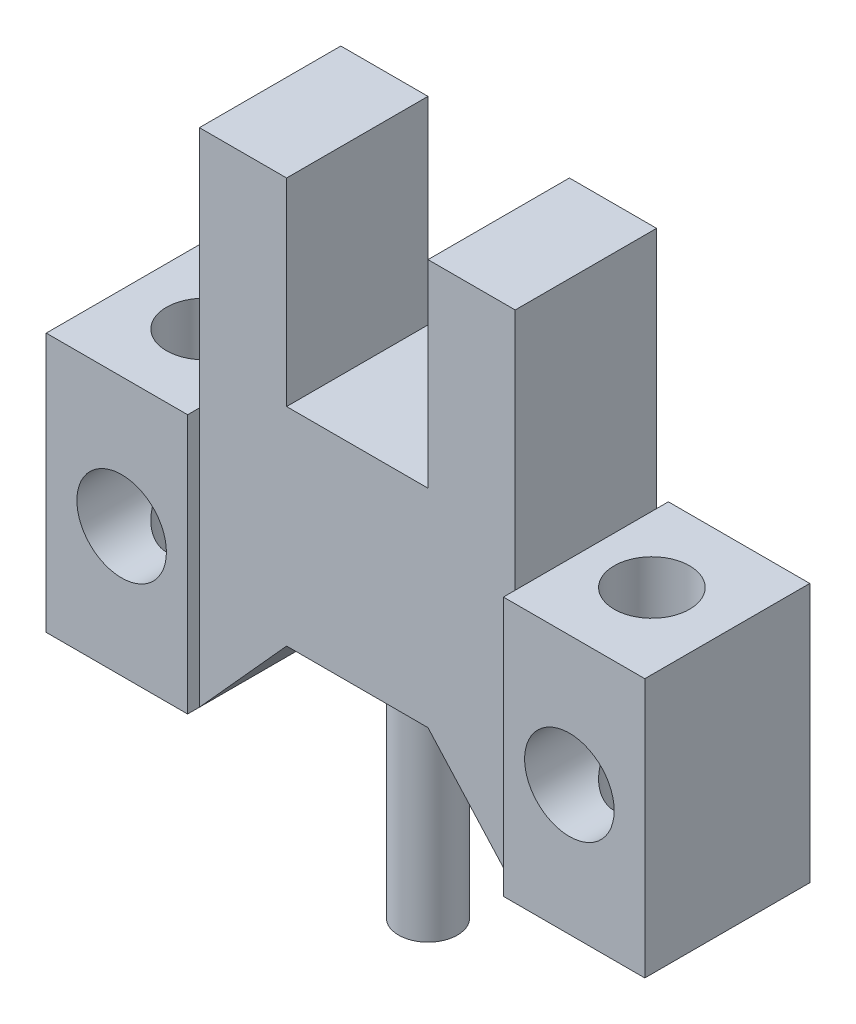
ISO-10303-21;
HEADER;
FILE_DESCRIPTION(('STEP AP214'),'2;1');
FILE_NAME('part.step','',(''),(''),'','','');
FILE_SCHEMA(('AUTOMOTIVE_DESIGN { 1 0 10303 214 1 1 1 1 }'));
ENDSEC;
DATA;
#1=APPLICATION_CONTEXT('core data for automotive mechanical design processes');
#2=APPLICATION_PROTOCOL_DEFINITION('international standard','automotive_design',2000,#1);
#3=PRODUCT_CONTEXT('',#1,'mechanical');
#4=PRODUCT('Part','Part','',(#3));
#5=PRODUCT_RELATED_PRODUCT_CATEGORY('part','',(#4));
#6=PRODUCT_DEFINITION_FORMATION('','',#4);
#7=PRODUCT_DEFINITION_CONTEXT('part definition',#1,'design');
#8=PRODUCT_DEFINITION('design','',#6,#7);
#9=PRODUCT_DEFINITION_SHAPE('','',#8);
#10=(LENGTH_UNIT() NAMED_UNIT(*) SI_UNIT(.MILLI.,.METRE.));
#11=(NAMED_UNIT(*) PLANE_ANGLE_UNIT() SI_UNIT($,.RADIAN.));
#12=(NAMED_UNIT(*) SI_UNIT($,.STERADIAN.) SOLID_ANGLE_UNIT());
#13=UNCERTAINTY_MEASURE_WITH_UNIT(LENGTH_MEASURE(1.E-05),#10,'distance_accuracy_value','');
#14=(GEOMETRIC_REPRESENTATION_CONTEXT(3) GLOBAL_UNCERTAINTY_ASSIGNED_CONTEXT((#13)) GLOBAL_UNIT_ASSIGNED_CONTEXT((#10,
#11,#12)) REPRESENTATION_CONTEXT('',''));
#15=CARTESIAN_POINT('',(0.,0.,0.));
#16=DIRECTION('',(0.,0.,1.));
#17=DIRECTION('',(1.,0.,0.));
#18=AXIS2_PLACEMENT_3D('',#15,#16,#17);
#19=CARTESIAN_POINT('',(15.7,11.,7.));
#20=DIRECTION('',(-1.,0.,0.));
#21=DIRECTION('',(0.,0.,1.));
#22=AXIS2_PLACEMENT_3D('',#19,#20,#21);
#23=PLANE('',#22);
#24=DIRECTION('',(0.,1.,0.));
#25=VECTOR('',#24,1.);
#26=CARTESIAN_POINT('',(15.7,21.3,0.5));
#27=LINE('',#26,#25);
#28=CARTESIAN_POINT('',(15.7,12.9,0.5));
#29=VERTEX_POINT('',#28);
#30=CARTESIAN_POINT('',(15.7,21.3,0.5));
#31=VERTEX_POINT('',#30);
#32=EDGE_CURVE('E284',#29,#31,#27,.T.);
#33=ORIENTED_EDGE('',*,*,#32,.F.);
#34=DIRECTION('',(0.,0.,-1.));
#35=VECTOR('',#34,1.);
#36=CARTESIAN_POINT('',(15.7,12.9,0.5));
#37=LINE('',#36,#35);
#38=CARTESIAN_POINT('',(15.7,12.9,6.5));
#39=VERTEX_POINT('',#38);
#40=EDGE_CURVE('E559',#39,#29,#37,.T.);
#41=ORIENTED_EDGE('',*,*,#40,.F.);
#42=DIRECTION('',(0.,-1.,0.));
#43=VECTOR('',#42,1.);
#44=CARTESIAN_POINT('',(15.7,11.,6.5));
#45=LINE('',#44,#43);
#46=CARTESIAN_POINT('',(15.7,21.3,6.5));
#47=VERTEX_POINT('',#46);
#48=EDGE_CURVE('E318',#47,#39,#45,.T.);
#49=ORIENTED_EDGE('',*,*,#48,.F.);
#50=DIRECTION('',(0.,0.,-1.));
#51=VECTOR('',#50,1.);
#52=CARTESIAN_POINT('',(15.7,21.3,7.));
#53=LINE('',#52,#51);
#54=EDGE_CURVE('E176',#47,#31,#53,.T.);
#55=ORIENTED_EDGE('',*,*,#54,.T.);
#56=EDGE_LOOP('',(#33,#41,#49,#55));
#57=FACE_BOUND('',#56,.T.);
#58=ADVANCED_FACE('F35',(#57),#23,.T.);
#59=CARTESIAN_POINT('',(9.7,21.3,7.));
#60=DIRECTION('',(1.,0.,0.));
#61=DIRECTION('',(0.,1.,0.));
#62=AXIS2_PLACEMENT_3D('',#59,#60,#61);
#63=PLANE('',#62);
#64=DIRECTION('',(0.,1.,0.));
#65=VECTOR('',#64,1.);
#66=CARTESIAN_POINT('',(9.7,21.3,6.5));
#67=LINE('',#66,#65);
#68=CARTESIAN_POINT('',(9.7,12.9,6.5));
#69=VERTEX_POINT('',#68);
#70=CARTESIAN_POINT('',(9.7,21.3,6.5));
#71=VERTEX_POINT('',#70);
#72=EDGE_CURVE('E321',#69,#71,#67,.T.);
#73=ORIENTED_EDGE('',*,*,#72,.F.);
#74=DIRECTION('',(0.,0.,1.));
#75=VECTOR('',#74,1.);
#76=CARTESIAN_POINT('',(9.7,12.9,6.5));
#77=LINE('',#76,#75);
#78=CARTESIAN_POINT('',(9.7,12.9,0.5));
#79=VERTEX_POINT('',#78);
#80=EDGE_CURVE('E448',#79,#69,#77,.T.);
#81=ORIENTED_EDGE('',*,*,#80,.F.);
#82=DIRECTION('',(0.,-1.,0.));
#83=VECTOR('',#82,1.);
#84=CARTESIAN_POINT('',(9.7,11.,0.5));
#85=LINE('',#84,#83);
#86=CARTESIAN_POINT('',(9.7,21.3,0.5));
#87=VERTEX_POINT('',#86);
#88=EDGE_CURVE('E281',#87,#79,#85,.T.);
#89=ORIENTED_EDGE('',*,*,#88,.F.);
#90=DIRECTION('',(0.,0.,-1.));
#91=VECTOR('',#90,1.);
#92=CARTESIAN_POINT('',(9.7,21.3,7.));
#93=LINE('',#92,#91);
#94=EDGE_CURVE('E179',#71,#87,#93,.T.);
#95=ORIENTED_EDGE('',*,*,#94,.F.);
#96=EDGE_LOOP('',(#73,#81,#89,#95));
#97=FACE_BOUND('',#96,.T.);
#98=ADVANCED_FACE('F446',(#97),#63,.T.);
#99=CARTESIAN_POINT('',(0.,0.,0.));
#100=DIRECTION('',(0.,0.,1.));
#101=DIRECTION('',(1.,0.,0.));
#102=AXIS2_PLACEMENT_3D('',#99,#100,#101);
#103=PLANE('',#102);
#104=CARTESIAN_POINT('',(22.2,5.5,0.));
#105=DIRECTION('',(0.,0.,1.));
#106=DIRECTION('',(1.,0.,0.));
#107=AXIS2_PLACEMENT_3D('',#104,#105,#106);
#108=CIRCLE('',#107,1.9);
#109=CARTESIAN_POINT('',(24.1,5.5,0.));
#110=VERTEX_POINT('',#109);
#111=EDGE_CURVE('E252',#110,#110,#108,.T.);
#112=ORIENTED_EDGE('',*,*,#111,.T.);
#113=EDGE_LOOP('',(#112));
#114=FACE_BOUND('',#113,.T.);
#115=DIRECTION('',(-1.,0.,0.));
#116=VECTOR('',#115,1.);
#117=CARTESIAN_POINT('',(25.4,0.,0.));
#118=LINE('',#117,#116);
#119=CARTESIAN_POINT('',(25.4,0.,0.));
#120=VERTEX_POINT('',#119);
#121=CARTESIAN_POINT('',(19.4,0.,0.));
#122=VERTEX_POINT('',#121);
#123=EDGE_CURVE('E147',#120,#122,#118,.T.);
#124=ORIENTED_EDGE('',*,*,#123,.T.);
#125=DIRECTION('',(0.,1.,0.));
#126=VECTOR('',#125,1.);
#127=CARTESIAN_POINT('',(19.4,0.,0.));
#128=LINE('',#127,#126);
#129=CARTESIAN_POINT('',(19.4,11.,0.));
#130=VERTEX_POINT('',#129);
#131=EDGE_CURVE('E44',#122,#130,#128,.T.);
#132=ORIENTED_EDGE('',*,*,#131,.T.);
#133=DIRECTION('',(1.,0.,0.));
#134=VECTOR('',#133,1.);
#135=CARTESIAN_POINT('',(19.4,11.,0.));
#136=LINE('',#135,#134);
#137=CARTESIAN_POINT('',(25.4,11.,0.));
#138=VERTEX_POINT('',#137);
#139=EDGE_CURVE('E140',#130,#138,#136,.T.);
#140=ORIENTED_EDGE('',*,*,#139,.T.);
#141=DIRECTION('',(0.,-1.,0.));
#142=VECTOR('',#141,1.);
#143=CARTESIAN_POINT('',(25.4,11.,0.));
#144=LINE('',#143,#142);
#145=EDGE_CURVE('E144',#138,#120,#144,.T.);
#146=ORIENTED_EDGE('',*,*,#145,.T.);
#147=EDGE_LOOP('',(#124,#132,#140,#146));
#148=FACE_BOUND('',#147,.T.);
#149=ADVANCED_FACE('F465',(#114,#148),#103,.F.);
#150=CARTESIAN_POINT('',(0.,0.,7.));
#151=DIRECTION('',(0.,0.,1.));
#152=DIRECTION('',(1.,0.,0.));
#153=AXIS2_PLACEMENT_3D('',#150,#151,#152);
#154=PLANE('',#153);
#155=CARTESIAN_POINT('',(3.2,5.5,7.));
#156=DIRECTION('',(0.,0.,1.));
#157=DIRECTION('',(1.,0.,0.));
#158=AXIS2_PLACEMENT_3D('',#155,#156,#157);
#159=CIRCLE('',#158,1.9);
#160=CARTESIAN_POINT('',(5.1,5.5,7.));
#161=VERTEX_POINT('',#160);
#162=EDGE_CURVE('E255',#161,#161,#159,.T.);
#163=ORIENTED_EDGE('',*,*,#162,.F.);
#164=EDGE_LOOP('',(#163));
#165=FACE_BOUND('',#164,.T.);
#166=DIRECTION('',(0.,-1.,0.));
#167=VECTOR('',#166,1.);
#168=CARTESIAN_POINT('',(6.,0.,7.));
#169=LINE('',#168,#167);
#170=CARTESIAN_POINT('',(6.,11.,7.));
#171=VERTEX_POINT('',#170);
#172=CARTESIAN_POINT('',(6.,0.,7.));
#173=VERTEX_POINT('',#172);
#174=EDGE_CURVE('E157',#171,#173,#169,.T.);
#175=ORIENTED_EDGE('',*,*,#174,.F.);
#176=DIRECTION('',(1.,0.,0.));
#177=VECTOR('',#176,1.);
#178=CARTESIAN_POINT('',(0.,11.,7.));
#179=LINE('',#178,#177);
#180=CARTESIAN_POINT('',(0.,11.,7.));
#181=VERTEX_POINT('',#180);
#182=EDGE_CURVE('E155',#181,#171,#179,.T.);
#183=ORIENTED_EDGE('',*,*,#182,.F.);
#184=DIRECTION('',(0.,1.,0.));
#185=VECTOR('',#184,1.);
#186=CARTESIAN_POINT('',(0.,0.,7.));
#187=LINE('',#186,#185);
#188=CARTESIAN_POINT('',(0.,0.,7.));
#189=VERTEX_POINT('',#188);
#190=EDGE_CURVE('E130',#189,#181,#187,.T.);
#191=ORIENTED_EDGE('',*,*,#190,.F.);
#192=DIRECTION('',(1.,0.,0.));
#193=VECTOR('',#192,1.);
#194=CARTESIAN_POINT('',(0.,0.,7.));
#195=LINE('',#194,#193);
#196=EDGE_CURVE('E126',#189,#173,#195,.T.);
#197=ORIENTED_EDGE('',*,*,#196,.T.);
#198=EDGE_LOOP('',(#175,#183,#191,#197));
#199=FACE_BOUND('',#198,.T.);
#200=ADVANCED_FACE('F417',(#165,#199),#154,.T.);
#201=CARTESIAN_POINT('',(0.,11.,7.));
#202=DIRECTION('',(0.,1.,0.));
#203=DIRECTION('',(0.,0.,1.));
#204=AXIS2_PLACEMENT_3D('',#201,#202,#203);
#205=PLANE('',#204);
#206=CARTESIAN_POINT('',(3.2,11.,3.5));
#207=DIRECTION('',(0.,1.,0.));
#208=DIRECTION('',(0.,0.,1.));
#209=AXIS2_PLACEMENT_3D('',#206,#207,#208);
#210=CIRCLE('',#209,1.6);
#211=CARTESIAN_POINT('',(3.2,11.,5.1));
#212=VERTEX_POINT('',#211);
#213=EDGE_CURVE('E231',#212,#212,#210,.T.);
#214=ORIENTED_EDGE('',*,*,#213,.F.);
#215=EDGE_LOOP('',(#214));
#216=FACE_BOUND('',#215,.T.);
#217=DIRECTION('',(1.,0.,0.));
#218=VECTOR('',#217,1.);
#219=CARTESIAN_POINT('',(0.,11.,0.));
#220=LINE('',#219,#218);
#221=CARTESIAN_POINT('',(0.,11.,0.));
#222=VERTEX_POINT('',#221);
#223=CARTESIAN_POINT('',(6.,11.,0.));
#224=VERTEX_POINT('',#223);
#225=EDGE_CURVE('E137',#222,#224,#220,.T.);
#226=ORIENTED_EDGE('',*,*,#225,.F.);
#227=DIRECTION('',(0.,0.,-1.));
#228=VECTOR('',#227,1.);
#229=CARTESIAN_POINT('',(0.,11.,7.));
#230=LINE('',#229,#228);
#231=EDGE_CURVE('E52',#181,#222,#230,.T.);
#232=ORIENTED_EDGE('',*,*,#231,.F.);
#233=ORIENTED_EDGE('',*,*,#182,.T.);
#234=DIRECTION('',(0.,0.,-1.));
#235=VECTOR('',#234,1.);
#236=CARTESIAN_POINT('',(6.,11.,7.));
#237=LINE('',#236,#235);
#238=CARTESIAN_POINT('',(6.,11.,6.5));
#239=VERTEX_POINT('',#238);
#240=EDGE_CURVE('E185',#171,#239,#237,.T.);
#241=ORIENTED_EDGE('',*,*,#240,.T.);
#242=CARTESIAN_POINT('',(6.,11.,0.5));
#243=VERTEX_POINT('',#242);
#244=EDGE_CURVE('E136',#239,#243,#237,.T.);
#245=ORIENTED_EDGE('',*,*,#244,.T.);
#246=DIRECTION('',(0.,0.,1.));
#247=VECTOR('',#246,1.);
#248=CARTESIAN_POINT('',(6.,11.,7.));
#249=LINE('',#248,#247);
#250=EDGE_CURVE('E300',#224,#243,#249,.T.);
#251=ORIENTED_EDGE('',*,*,#250,.F.);
#252=EDGE_LOOP('',(#226,#232,#233,#241,#245,#251));
#253=FACE_BOUND('',#252,.T.);
#254=ADVANCED_FACE('F37',(#216,#253),#205,.T.);
#255=CARTESIAN_POINT('',(0.,0.,7.));
#256=DIRECTION('',(-1.,0.,0.));
#257=DIRECTION('',(0.,0.,1.));
#258=AXIS2_PLACEMENT_3D('',#255,#256,#257);
#259=PLANE('',#258);
#260=DIRECTION('',(0.,1.,0.));
#261=VECTOR('',#260,1.);
#262=CARTESIAN_POINT('',(0.,0.,0.));
#263=LINE('',#262,#261);
#264=CARTESIAN_POINT('',(0.,0.,0.));
#265=VERTEX_POINT('',#264);
#266=EDGE_CURVE('E152',#265,#222,#263,.T.);
#267=ORIENTED_EDGE('',*,*,#266,.F.);
#268=DIRECTION('',(0.,0.,-1.));
#269=VECTOR('',#268,1.);
#270=CARTESIAN_POINT('',(0.,0.,7.));
#271=LINE('',#270,#269);
#272=EDGE_CURVE('E73',#189,#265,#271,.T.);
#273=ORIENTED_EDGE('',*,*,#272,.F.);
#274=ORIENTED_EDGE('',*,*,#190,.T.);
#275=ORIENTED_EDGE('',*,*,#231,.T.);
#276=EDGE_LOOP('',(#267,#273,#274,#275));
#277=FACE_BOUND('',#276,.T.);
#278=ADVANCED_FACE('F418',(#277),#259,.T.);
#279=CARTESIAN_POINT('',(0.,0.,7.));
#280=DIRECTION('',(0.,1.,0.));
#281=DIRECTION('',(0.,0.,1.));
#282=AXIS2_PLACEMENT_3D('',#279,#280,#281);
#283=PLANE('',#282);
#284=CARTESIAN_POINT('',(3.2,0.,3.5));
#285=DIRECTION('',(0.,1.,0.));
#286=DIRECTION('',(0.,0.,1.));
#287=AXIS2_PLACEMENT_3D('',#284,#285,#286);
#288=CIRCLE('',#287,1.6);
#289=CARTESIAN_POINT('',(3.2,0.,5.1));
#290=VERTEX_POINT('',#289);
#291=EDGE_CURVE('E200',#290,#290,#288,.T.);
#292=ORIENTED_EDGE('',*,*,#291,.T.);
#293=EDGE_LOOP('',(#292));
#294=FACE_BOUND('',#293,.T.);
#295=DIRECTION('',(1.,0.,0.));
#296=VECTOR('',#295,1.);
#297=CARTESIAN_POINT('',(0.,0.,0.));
#298=LINE('',#297,#296);
#299=CARTESIAN_POINT('',(6.,0.,0.));
#300=VERTEX_POINT('',#299);
#301=EDGE_CURVE('E150',#265,#300,#298,.T.);
#302=ORIENTED_EDGE('',*,*,#301,.T.);
#303=DIRECTION('',(0.,0.,-1.));
#304=VECTOR('',#303,1.);
#305=CARTESIAN_POINT('',(6.,0.,0.5));
#306=LINE('',#305,#304);
#307=CARTESIAN_POINT('',(6.,0.,0.5));
#308=VERTEX_POINT('',#307);
#309=EDGE_CURVE('E294',#308,#300,#306,.T.);
#310=ORIENTED_EDGE('',*,*,#309,.F.);
#311=DIRECTION('',(0.,0.,-1.));
#312=VECTOR('',#311,1.);
#313=CARTESIAN_POINT('',(6.,0.,7.));
#314=LINE('',#313,#312);
#315=CARTESIAN_POINT('',(6.,0.,6.5));
#316=VERTEX_POINT('',#315);
#317=EDGE_CURVE('E162',#316,#308,#314,.T.);
#318=ORIENTED_EDGE('',*,*,#317,.F.);
#319=EDGE_CURVE('E159',#173,#316,#314,.T.);
#320=ORIENTED_EDGE('',*,*,#319,.F.);
#321=ORIENTED_EDGE('',*,*,#196,.F.);
#322=ORIENTED_EDGE('',*,*,#272,.T.);
#323=EDGE_LOOP('',(#302,#310,#318,#320,#321,#322));
#324=FACE_BOUND('',#323,.T.);
#325=ADVANCED_FACE('F419',(#294,#324),#283,.F.);
#326=CARTESIAN_POINT('',(6.,0.,7.));
#327=DIRECTION('',(-0.742393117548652,0.669964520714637,0.));
#328=DIRECTION('',(-0.669964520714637,-0.742393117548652,0.));
#329=AXIS2_PLACEMENT_3D('',#326,#327,#328);
#330=PLANE('',#329);
#331=ORIENTED_EDGE('',*,*,#317,.T.);
#332=DIRECTION('',(-0.669964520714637,-0.742393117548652,0.));
#333=VECTOR('',#332,1.);
#334=CARTESIAN_POINT('',(6.,0.,0.5));
#335=LINE('',#334,#333);
#336=CARTESIAN_POINT('',(9.7,4.1,0.5));
#337=VERTEX_POINT('',#336);
#338=EDGE_CURVE('E271',#337,#308,#335,.T.);
#339=ORIENTED_EDGE('',*,*,#338,.F.);
#340=DIRECTION('',(0.,0.,-1.));
#341=VECTOR('',#340,1.);
#342=CARTESIAN_POINT('',(9.7,4.1,7.));
#343=LINE('',#342,#341);
#344=CARTESIAN_POINT('',(9.7,4.1,6.5));
#345=VERTEX_POINT('',#344);
#346=EDGE_CURVE('E163',#345,#337,#343,.T.);
#347=ORIENTED_EDGE('',*,*,#346,.F.);
#348=DIRECTION('',(0.669964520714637,0.742393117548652,0.));
#349=VECTOR('',#348,1.);
#350=CARTESIAN_POINT('',(9.7,4.1,6.5));
#351=LINE('',#350,#349);
#352=EDGE_CURVE('E120',#316,#345,#351,.T.);
#353=ORIENTED_EDGE('',*,*,#352,.F.);
#354=EDGE_LOOP('',(#331,#339,#347,#353));
#355=FACE_BOUND('',#354,.T.);
#356=ADVANCED_FACE('F426',(#355),#330,.F.);
#357=CARTESIAN_POINT('',(9.7,4.1,7.));
#358=DIRECTION('',(0.,1.,0.));
#359=DIRECTION('',(0.,0.,1.));
#360=AXIS2_PLACEMENT_3D('',#357,#358,#359);
#361=PLANE('',#360);
#362=CARTESIAN_POINT('',(12.7,4.1,3.5));
#363=DIRECTION('',(0.,1.,0.));
#364=DIRECTION('',(0.,0.,1.));
#365=AXIS2_PLACEMENT_3D('',#362,#363,#364);
#366=CIRCLE('',#365,1.25);
#367=CARTESIAN_POINT('',(12.7,4.1,4.75));
#368=VERTEX_POINT('',#367);
#369=EDGE_CURVE('E11',#368,#368,#366,.F.);
#370=ORIENTED_EDGE('',*,*,#369,.F.);
#371=EDGE_LOOP('',(#370));
#372=FACE_BOUND('',#371,.T.);
#373=ORIENTED_EDGE('',*,*,#346,.T.);
#374=DIRECTION('',(-1.,0.,0.));
#375=VECTOR('',#374,1.);
#376=CARTESIAN_POINT('',(9.7,4.1,0.5));
#377=LINE('',#376,#375);
#378=CARTESIAN_POINT('',(15.7,4.1,0.5));
#379=VERTEX_POINT('',#378);
#380=EDGE_CURVE('E268',#379,#337,#377,.T.);
#381=ORIENTED_EDGE('',*,*,#380,.F.);
#382=DIRECTION('',(0.,0.,-1.));
#383=VECTOR('',#382,1.);
#384=CARTESIAN_POINT('',(15.7,4.1,7.));
#385=LINE('',#384,#383);
#386=CARTESIAN_POINT('',(15.7,4.1,6.5));
#387=VERTEX_POINT('',#386);
#388=EDGE_CURVE('E110',#387,#379,#385,.T.);
#389=ORIENTED_EDGE('',*,*,#388,.F.);
#390=DIRECTION('',(1.,0.,0.));
#391=VECTOR('',#390,1.);
#392=CARTESIAN_POINT('',(15.7,4.1,6.5));
#393=LINE('',#392,#391);
#394=EDGE_CURVE('E308',#345,#387,#393,.T.);
#395=ORIENTED_EDGE('',*,*,#394,.F.);
#396=EDGE_LOOP('',(#373,#381,#389,#395));
#397=FACE_BOUND('',#396,.T.);
#398=ADVANCED_FACE('F481',(#372,#397),#361,.F.);
#399=CARTESIAN_POINT('',(19.4,0.,7.));
#400=DIRECTION('',(-0.742393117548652,-0.669964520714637,0.));
#401=DIRECTION('',(0.669964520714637,-0.742393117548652,0.));
#402=AXIS2_PLACEMENT_3D('',#399,#400,#401);
#403=PLANE('',#402);
#404=DIRECTION('',(-0.669964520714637,0.742393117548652,0.));
#405=VECTOR('',#404,1.);
#406=CARTESIAN_POINT('',(15.7,4.1,0.5));
#407=LINE('',#406,#405);
#408=CARTESIAN_POINT('',(19.4,0.,0.5));
#409=VERTEX_POINT('',#408);
#410=EDGE_CURVE('E265',#409,#379,#407,.T.);
#411=ORIENTED_EDGE('',*,*,#410,.F.);
#412=DIRECTION('',(0.,0.,-1.));
#413=VECTOR('',#412,1.);
#414=CARTESIAN_POINT('',(19.4,0.,7.));
#415=LINE('',#414,#413);
#416=CARTESIAN_POINT('',(19.4,0.,6.5));
#417=VERTEX_POINT('',#416);
#418=EDGE_CURVE('E111',#417,#409,#415,.T.);
#419=ORIENTED_EDGE('',*,*,#418,.F.);
#420=DIRECTION('',(0.669964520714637,-0.742393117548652,0.));
#421=VECTOR('',#420,1.);
#422=CARTESIAN_POINT('',(19.4,0.,6.5));
#423=LINE('',#422,#421);
#424=EDGE_CURVE('E311',#387,#417,#423,.T.);
#425=ORIENTED_EDGE('',*,*,#424,.F.);
#426=ORIENTED_EDGE('',*,*,#388,.T.);
#427=EDGE_LOOP('',(#411,#419,#425,#426));
#428=FACE_BOUND('',#427,.T.);
#429=ADVANCED_FACE('F478',(#428),#403,.T.);
#430=CARTESIAN_POINT('',(25.4,0.,7.));
#431=DIRECTION('',(0.,-1.,0.));
#432=DIRECTION('',(1.,0.,0.));
#433=AXIS2_PLACEMENT_3D('',#430,#431,#432);
#434=PLANE('',#433);
#435=CARTESIAN_POINT('',(22.2,0.,3.5));
#436=DIRECTION('',(0.,1.,0.));
#437=DIRECTION('',(0.,0.,1.));
#438=AXIS2_PLACEMENT_3D('',#435,#436,#437);
#439=CIRCLE('',#438,1.6);
#440=CARTESIAN_POINT('',(22.2,0.,5.1));
#441=VERTEX_POINT('',#440);
#442=EDGE_CURVE('E236',#441,#441,#439,.T.);
#443=ORIENTED_EDGE('',*,*,#442,.T.);
#444=EDGE_LOOP('',(#443));
#445=FACE_BOUND('',#444,.T.);
#446=ORIENTED_EDGE('',*,*,#123,.F.);
#447=DIRECTION('',(0.,0.,-1.));
#448=VECTOR('',#447,1.);
#449=CARTESIAN_POINT('',(25.4,0.,7.));
#450=LINE('',#449,#448);
#451=CARTESIAN_POINT('',(25.4,0.,7.));
#452=VERTEX_POINT('',#451);
#453=EDGE_CURVE('E125',#452,#120,#450,.T.);
#454=ORIENTED_EDGE('',*,*,#453,.F.);
#455=DIRECTION('',(-1.,0.,0.));
#456=VECTOR('',#455,1.);
#457=CARTESIAN_POINT('',(25.4,0.,7.));
#458=LINE('',#457,#456);
#459=CARTESIAN_POINT('',(19.4,0.,7.));
#460=VERTEX_POINT('',#459);
#461=EDGE_CURVE('E117',#452,#460,#458,.T.);
#462=ORIENTED_EDGE('',*,*,#461,.T.);
#463=EDGE_CURVE('E96',#460,#417,#415,.T.);
#464=ORIENTED_EDGE('',*,*,#463,.T.);
#465=ORIENTED_EDGE('',*,*,#418,.T.);
#466=DIRECTION('',(0.,0.,-1.));
#467=VECTOR('',#466,1.);
#468=CARTESIAN_POINT('',(19.4,0.,0.5));
#469=LINE('',#468,#467);
#470=EDGE_CURVE('E297',#409,#122,#469,.T.);
#471=ORIENTED_EDGE('',*,*,#470,.T.);
#472=EDGE_LOOP('',(#446,#454,#462,#464,#465,#471));
#473=FACE_BOUND('',#472,.T.);
#474=ADVANCED_FACE('F124',(#445,#473),#434,.T.);
#475=CARTESIAN_POINT('',(25.4,11.,7.));
#476=DIRECTION('',(1.,0.,0.));
#477=DIRECTION('',(0.,0.,-1.));
#478=AXIS2_PLACEMENT_3D('',#475,#476,#477);
#479=PLANE('',#478);
#480=ORIENTED_EDGE('',*,*,#145,.F.);
#481=DIRECTION('',(0.,0.,-1.));
#482=VECTOR('',#481,1.);
#483=CARTESIAN_POINT('',(25.4,11.,7.));
#484=LINE('',#483,#482);
#485=CARTESIAN_POINT('',(25.4,11.,7.));
#486=VERTEX_POINT('',#485);
#487=EDGE_CURVE('E85',#486,#138,#484,.T.);
#488=ORIENTED_EDGE('',*,*,#487,.F.);
#489=DIRECTION('',(0.,-1.,0.));
#490=VECTOR('',#489,1.);
#491=CARTESIAN_POINT('',(25.4,11.,7.));
#492=LINE('',#491,#490);
#493=EDGE_CURVE('E127',#486,#452,#492,.T.);
#494=ORIENTED_EDGE('',*,*,#493,.T.);
#495=ORIENTED_EDGE('',*,*,#453,.T.);
#496=EDGE_LOOP('',(#480,#488,#494,#495));
#497=FACE_BOUND('',#496,.T.);
#498=ADVANCED_FACE('F472',(#497),#479,.T.);
#499=CARTESIAN_POINT('',(19.4,11.,7.));
#500=DIRECTION('',(0.,1.,0.));
#501=DIRECTION('',(0.,0.,1.));
#502=AXIS2_PLACEMENT_3D('',#499,#500,#501);
#503=PLANE('',#502);
#504=CARTESIAN_POINT('',(22.2,11.,3.5));
#505=DIRECTION('',(0.,1.,0.));
#506=DIRECTION('',(0.,0.,1.));
#507=AXIS2_PLACEMENT_3D('',#504,#505,#506);
#508=CIRCLE('',#507,1.6);
#509=CARTESIAN_POINT('',(22.2,11.,5.1));
#510=VERTEX_POINT('',#509);
#511=EDGE_CURVE('E240',#510,#510,#508,.T.);
#512=ORIENTED_EDGE('',*,*,#511,.F.);
#513=EDGE_LOOP('',(#512));
#514=FACE_BOUND('',#513,.T.);
#515=ORIENTED_EDGE('',*,*,#139,.F.);
#516=DIRECTION('',(0.,0.,-1.));
#517=VECTOR('',#516,1.);
#518=CARTESIAN_POINT('',(19.4,11.,7.));
#519=LINE('',#518,#517);
#520=CARTESIAN_POINT('',(19.4,11.,0.5));
#521=VERTEX_POINT('',#520);
#522=EDGE_CURVE('E121',#521,#130,#519,.T.);
#523=ORIENTED_EDGE('',*,*,#522,.F.);
#524=DIRECTION('',(0.,0.,-1.));
#525=VECTOR('',#524,1.);
#526=CARTESIAN_POINT('',(19.4,11.,7.));
#527=LINE('',#526,#525);
#528=CARTESIAN_POINT('',(19.4,11.,6.5));
#529=VERTEX_POINT('',#528);
#530=EDGE_CURVE('E172',#529,#521,#527,.T.);
#531=ORIENTED_EDGE('',*,*,#530,.F.);
#532=CARTESIAN_POINT('',(19.4,11.,7.));
#533=VERTEX_POINT('',#532);
#534=EDGE_CURVE('E170',#533,#529,#527,.T.);
#535=ORIENTED_EDGE('',*,*,#534,.F.);
#536=DIRECTION('',(1.,0.,0.));
#537=VECTOR('',#536,1.);
#538=CARTESIAN_POINT('',(19.4,11.,7.));
#539=LINE('',#538,#537);
#540=EDGE_CURVE('E119',#533,#486,#539,.T.);
#541=ORIENTED_EDGE('',*,*,#540,.T.);
#542=ORIENTED_EDGE('',*,*,#487,.T.);
#543=EDGE_LOOP('',(#515,#523,#531,#535,#541,#542));
#544=FACE_BOUND('',#543,.T.);
#545=ADVANCED_FACE('F332',(#514,#544),#503,.T.);
#546=CARTESIAN_POINT('',(19.4,21.3,7.));
#547=DIRECTION('',(1.,0.,0.));
#548=DIRECTION('',(0.,0.,-1.));
#549=AXIS2_PLACEMENT_3D('',#546,#547,#548);
#550=PLANE('',#549);
#551=DIRECTION('',(0.,-1.,0.));
#552=VECTOR('',#551,1.);
#553=CARTESIAN_POINT('',(19.4,0.,0.5));
#554=LINE('',#553,#552);
#555=CARTESIAN_POINT('',(19.4,21.3,0.5));
#556=VERTEX_POINT('',#555);
#557=EDGE_CURVE('E291',#556,#521,#554,.T.);
#558=ORIENTED_EDGE('',*,*,#557,.F.);
#559=DIRECTION('',(0.,0.,-1.));
#560=VECTOR('',#559,1.);
#561=CARTESIAN_POINT('',(19.4,21.3,7.));
#562=LINE('',#561,#560);
#563=CARTESIAN_POINT('',(19.4,21.3,6.5));
#564=VERTEX_POINT('',#563);
#565=EDGE_CURVE('E173',#564,#556,#562,.T.);
#566=ORIENTED_EDGE('',*,*,#565,.F.);
#567=DIRECTION('',(0.,1.,0.));
#568=VECTOR('',#567,1.);
#569=CARTESIAN_POINT('',(19.4,21.3,6.5));
#570=LINE('',#569,#568);
#571=EDGE_CURVE('E313',#529,#564,#570,.T.);
#572=ORIENTED_EDGE('',*,*,#571,.F.);
#573=ORIENTED_EDGE('',*,*,#530,.T.);
#574=EDGE_LOOP('',(#558,#566,#572,#573));
#575=FACE_BOUND('',#574,.T.);
#576=ADVANCED_FACE('F353',(#575),#550,.T.);
#577=CARTESIAN_POINT('',(15.7,21.3,7.));
#578=DIRECTION('',(0.,1.,0.));
#579=DIRECTION('',(0.,0.,1.));
#580=AXIS2_PLACEMENT_3D('',#577,#578,#579);
#581=PLANE('',#580);
#582=DIRECTION('',(1.,0.,0.));
#583=VECTOR('',#582,1.);
#584=CARTESIAN_POINT('',(19.4,21.3,0.5));
#585=LINE('',#584,#583);
#586=EDGE_CURVE('E287',#31,#556,#585,.T.);
#587=ORIENTED_EDGE('',*,*,#586,.F.);
#588=ORIENTED_EDGE('',*,*,#54,.F.);
#589=DIRECTION('',(-1.,0.,0.));
#590=VECTOR('',#589,1.);
#591=CARTESIAN_POINT('',(15.7,21.3,6.5));
#592=LINE('',#591,#590);
#593=EDGE_CURVE('E315',#564,#47,#592,.T.);
#594=ORIENTED_EDGE('',*,*,#593,.F.);
#595=ORIENTED_EDGE('',*,*,#565,.T.);
#596=EDGE_LOOP('',(#587,#588,#594,#595));
#597=FACE_BOUND('',#596,.T.);
#598=ADVANCED_FACE('F360',(#597),#581,.T.);
#599=CARTESIAN_POINT('',(6.,21.3,7.));
#600=DIRECTION('',(0.,1.,0.));
#601=DIRECTION('',(0.,0.,1.));
#602=AXIS2_PLACEMENT_3D('',#599,#600,#601);
#603=PLANE('',#602);
#604=DIRECTION('',(1.,0.,0.));
#605=VECTOR('',#604,1.);
#606=CARTESIAN_POINT('',(9.7,21.3,0.5));
#607=LINE('',#606,#605);
#608=CARTESIAN_POINT('',(6.,21.3,0.5));
#609=VERTEX_POINT('',#608);
#610=EDGE_CURVE('E278',#609,#87,#607,.T.);
#611=ORIENTED_EDGE('',*,*,#610,.F.);
#612=DIRECTION('',(0.,0.,-1.));
#613=VECTOR('',#612,1.);
#614=CARTESIAN_POINT('',(6.,21.3,7.));
#615=LINE('',#614,#613);
#616=CARTESIAN_POINT('',(6.,21.3,6.5));
#617=VERTEX_POINT('',#616);
#618=EDGE_CURVE('E182',#617,#609,#615,.T.);
#619=ORIENTED_EDGE('',*,*,#618,.F.);
#620=DIRECTION('',(-1.,0.,0.));
#621=VECTOR('',#620,1.);
#622=CARTESIAN_POINT('',(6.,21.3,6.5));
#623=LINE('',#622,#621);
#624=EDGE_CURVE('E324',#71,#617,#623,.T.);
#625=ORIENTED_EDGE('',*,*,#624,.F.);
#626=ORIENTED_EDGE('',*,*,#94,.T.);
#627=EDGE_LOOP('',(#611,#619,#625,#626));
#628=FACE_BOUND('',#627,.T.);
#629=ADVANCED_FACE('F449',(#628),#603,.T.);
#630=CARTESIAN_POINT('',(6.,11.,7.));
#631=DIRECTION('',(-1.,0.,0.));
#632=DIRECTION('',(0.,0.,1.));
#633=AXIS2_PLACEMENT_3D('',#630,#631,#632);
#634=PLANE('',#633);
#635=DIRECTION('',(0.,1.,0.));
#636=VECTOR('',#635,1.);
#637=CARTESIAN_POINT('',(6.,21.3,0.5));
#638=LINE('',#637,#636);
#639=EDGE_CURVE('E274',#243,#609,#638,.T.);
#640=ORIENTED_EDGE('',*,*,#639,.F.);
#641=ORIENTED_EDGE('',*,*,#244,.F.);
#642=DIRECTION('',(0.,-1.,0.));
#643=VECTOR('',#642,1.);
#644=CARTESIAN_POINT('',(6.,0.,6.5));
#645=LINE('',#644,#643);
#646=EDGE_CURVE('E141',#617,#239,#645,.T.);
#647=ORIENTED_EDGE('',*,*,#646,.F.);
#648=ORIENTED_EDGE('',*,*,#618,.T.);
#649=EDGE_LOOP('',(#640,#641,#647,#648));
#650=FACE_BOUND('',#649,.T.);
#651=ADVANCED_FACE('F412',(#650),#634,.T.);
#652=CARTESIAN_POINT('',(22.2,5.5,7.));
#653=DIRECTION('',(0.,0.,1.));
#654=DIRECTION('',(1.,0.,0.));
#655=AXIS2_PLACEMENT_3D('',#652,#653,#654);
#656=CIRCLE('',#655,1.9);
#657=CARTESIAN_POINT('',(24.1,5.5,7.));
#658=VERTEX_POINT('',#657);
#659=EDGE_CURVE('E256',#658,#658,#656,.T.);
#660=ORIENTED_EDGE('',*,*,#659,.F.);
#661=EDGE_LOOP('',(#660));
#662=FACE_BOUND('',#661,.T.);
#663=DIRECTION('',(0.,1.,0.));
#664=VECTOR('',#663,1.);
#665=CARTESIAN_POINT('',(19.4,21.3,7.));
#666=LINE('',#665,#664);
#667=EDGE_CURVE('E101',#460,#533,#666,.T.);
#668=ORIENTED_EDGE('',*,*,#667,.F.);
#669=ORIENTED_EDGE('',*,*,#461,.F.);
#670=ORIENTED_EDGE('',*,*,#493,.F.);
#671=ORIENTED_EDGE('',*,*,#540,.F.);
#672=EDGE_LOOP('',(#668,#669,#670,#671));
#673=FACE_BOUND('',#672,.T.);
#674=ADVANCED_FACE('F116',(#662,#673),#154,.T.);
#675=CARTESIAN_POINT('',(3.2,5.5,0.));
#676=DIRECTION('',(0.,0.,1.));
#677=DIRECTION('',(1.,0.,0.));
#678=AXIS2_PLACEMENT_3D('',#675,#676,#677);
#679=CIRCLE('',#678,1.9);
#680=CARTESIAN_POINT('',(5.1,5.5,0.));
#681=VERTEX_POINT('',#680);
#682=EDGE_CURVE('E259',#681,#681,#679,.T.);
#683=ORIENTED_EDGE('',*,*,#682,.T.);
#684=EDGE_LOOP('',(#683));
#685=FACE_BOUND('',#684,.T.);
#686=ORIENTED_EDGE('',*,*,#225,.T.);
#687=DIRECTION('',(0.,1.,0.));
#688=VECTOR('',#687,1.);
#689=CARTESIAN_POINT('',(6.,21.3,0.));
#690=LINE('',#689,#688);
#691=EDGE_CURVE('E262',#300,#224,#690,.T.);
#692=ORIENTED_EDGE('',*,*,#691,.F.);
#693=ORIENTED_EDGE('',*,*,#301,.F.);
#694=ORIENTED_EDGE('',*,*,#266,.T.);
#695=EDGE_LOOP('',(#686,#692,#693,#694));
#696=FACE_BOUND('',#695,.T.);
#697=ADVANCED_FACE('F493',(#685,#696),#103,.F.);
#698=CARTESIAN_POINT('',(6.,0.,6.5));
#699=DIRECTION('',(-1.,0.,0.));
#700=DIRECTION('',(0.,0.,1.));
#701=AXIS2_PLACEMENT_3D('',#698,#699,#700);
#702=PLANE('',#701);
#703=ORIENTED_EDGE('',*,*,#240,.F.);
#704=ORIENTED_EDGE('',*,*,#174,.T.);
#705=ORIENTED_EDGE('',*,*,#319,.T.);
#706=EDGE_CURVE('E327',#239,#316,#645,.T.);
#707=ORIENTED_EDGE('',*,*,#706,.F.);
#708=EDGE_LOOP('',(#703,#704,#705,#707));
#709=FACE_BOUND('',#708,.T.);
#710=ADVANCED_FACE('F402',(#709),#702,.F.);
#711=CARTESIAN_POINT('',(19.4,21.3,6.5));
#712=DIRECTION('',(1.,0.,0.));
#713=DIRECTION('',(0.,1.,0.));
#714=AXIS2_PLACEMENT_3D('',#711,#712,#713);
#715=PLANE('',#714);
#716=ORIENTED_EDGE('',*,*,#534,.T.);
#717=EDGE_CURVE('E105',#417,#529,#570,.T.);
#718=ORIENTED_EDGE('',*,*,#717,.F.);
#719=ORIENTED_EDGE('',*,*,#463,.F.);
#720=ORIENTED_EDGE('',*,*,#667,.T.);
#721=EDGE_LOOP('',(#716,#718,#719,#720));
#722=FACE_BOUND('',#721,.T.);
#723=ADVANCED_FACE('F99',(#722),#715,.F.);
#724=CARTESIAN_POINT('',(0.,0.,6.5));
#725=DIRECTION('',(0.,0.,-1.));
#726=DIRECTION('',(-1.,0.,0.));
#727=AXIS2_PLACEMENT_3D('',#724,#725,#726);
#728=PLANE('',#727);
#729=DIRECTION('',(1.,0.,0.));
#730=VECTOR('',#729,1.);
#731=CARTESIAN_POINT('',(15.7,12.9,6.5));
#732=LINE('',#731,#730);
#733=EDGE_CURVE('E556',#69,#39,#732,.T.);
#734=ORIENTED_EDGE('',*,*,#733,.F.);
#735=ORIENTED_EDGE('',*,*,#72,.T.);
#736=ORIENTED_EDGE('',*,*,#624,.T.);
#737=ORIENTED_EDGE('',*,*,#646,.T.);
#738=ORIENTED_EDGE('',*,*,#706,.T.);
#739=ORIENTED_EDGE('',*,*,#352,.T.);
#740=ORIENTED_EDGE('',*,*,#394,.T.);
#741=ORIENTED_EDGE('',*,*,#424,.T.);
#742=ORIENTED_EDGE('',*,*,#717,.T.);
#743=ORIENTED_EDGE('',*,*,#571,.T.);
#744=ORIENTED_EDGE('',*,*,#593,.T.);
#745=ORIENTED_EDGE('',*,*,#48,.T.);
#746=EDGE_LOOP('',(#734,#735,#736,#737,#738,#739,#740,#741,#742,#743,#744,#745));
#747=FACE_BOUND('',#746,.T.);
#748=ADVANCED_FACE('F345',(#747),#728,.F.);
#749=CARTESIAN_POINT('',(19.4,0.,0.5));
#750=DIRECTION('',(1.,0.,0.));
#751=DIRECTION('',(0.,1.,0.));
#752=AXIS2_PLACEMENT_3D('',#749,#750,#751);
#753=PLANE('',#752);
#754=ORIENTED_EDGE('',*,*,#522,.T.);
#755=ORIENTED_EDGE('',*,*,#131,.F.);
#756=ORIENTED_EDGE('',*,*,#470,.F.);
#757=EDGE_CURVE('E290',#521,#409,#554,.T.);
#758=ORIENTED_EDGE('',*,*,#757,.F.);
#759=EDGE_LOOP('',(#754,#755,#756,#758));
#760=FACE_BOUND('',#759,.T.);
#761=ADVANCED_FACE('F506',(#760),#753,.F.);
#762=CARTESIAN_POINT('',(6.,21.3,0.5));
#763=DIRECTION('',(-1.,0.,0.));
#764=DIRECTION('',(0.,0.,1.));
#765=AXIS2_PLACEMENT_3D('',#762,#763,#764);
#766=PLANE('',#765);
#767=ORIENTED_EDGE('',*,*,#250,.T.);
#768=EDGE_CURVE('E275',#308,#243,#638,.T.);
#769=ORIENTED_EDGE('',*,*,#768,.F.);
#770=ORIENTED_EDGE('',*,*,#309,.T.);
#771=ORIENTED_EDGE('',*,*,#691,.T.);
#772=EDGE_LOOP('',(#767,#769,#770,#771));
#773=FACE_BOUND('',#772,.T.);
#774=ADVANCED_FACE('F507',(#773),#766,.F.);
#775=CARTESIAN_POINT('',(0.,0.,0.5));
#776=DIRECTION('',(0.,0.,1.));
#777=DIRECTION('',(1.,0.,0.));
#778=AXIS2_PLACEMENT_3D('',#775,#776,#777);
#779=PLANE('',#778);
#780=DIRECTION('',(-1.,0.,0.));
#781=VECTOR('',#780,1.);
#782=CARTESIAN_POINT('',(9.7,12.9,0.5));
#783=LINE('',#782,#781);
#784=EDGE_CURVE('E562',#29,#79,#783,.T.);
#785=ORIENTED_EDGE('',*,*,#784,.F.);
#786=ORIENTED_EDGE('',*,*,#32,.T.);
#787=ORIENTED_EDGE('',*,*,#586,.T.);
#788=ORIENTED_EDGE('',*,*,#557,.T.);
#789=ORIENTED_EDGE('',*,*,#757,.T.);
#790=ORIENTED_EDGE('',*,*,#410,.T.);
#791=ORIENTED_EDGE('',*,*,#380,.T.);
#792=ORIENTED_EDGE('',*,*,#338,.T.);
#793=ORIENTED_EDGE('',*,*,#768,.T.);
#794=ORIENTED_EDGE('',*,*,#639,.T.);
#795=ORIENTED_EDGE('',*,*,#610,.T.);
#796=ORIENTED_EDGE('',*,*,#88,.T.);
#797=EDGE_LOOP('',(#785,#786,#787,#788,#789,#790,#791,#792,#793,#794,#795,#796));
#798=FACE_BOUND('',#797,.T.);
#799=ADVANCED_FACE('F439',(#798),#779,.F.);
#800=CARTESIAN_POINT('',(3.2,5.5,0.));
#801=DIRECTION('',(0.,0.,1.));
#802=DIRECTION('',(1.,0.,0.));
#803=AXIS2_PLACEMENT_3D('',#800,#801,#802);
#804=CYLINDRICAL_SURFACE('',#803,1.9);
#805=CARTESIAN_POINT('',(3.2,3.6,5.1));
#806=CARTESIAN_POINT('',(3.12433396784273,3.60000612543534,5.09999373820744));
#807=CARTESIAN_POINT('',(3.04856311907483,3.60456586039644,5.09458625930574));
#808=CARTESIAN_POINT('',(2.89948593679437,3.62240611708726,5.07333742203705));
#809=CARTESIAN_POINT('',(2.82618520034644,3.63570520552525,5.05747384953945));
#810=CARTESIAN_POINT('',(2.6846398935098,3.66978965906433,5.01650861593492));
#811=CARTESIAN_POINT('',(2.61636552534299,3.69052574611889,4.99146774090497));
#812=CARTESIAN_POINT('',(2.48562015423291,3.73803773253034,4.93345256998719));
#813=CARTESIAN_POINT('',(2.42314945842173,3.76481395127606,4.90047785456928));
#814=CARTESIAN_POINT('',(2.28250813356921,3.83374492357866,4.81427334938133));
#815=CARTESIAN_POINT('',(2.20714493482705,3.87791466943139,4.75807224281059));
#816=CARTESIAN_POINT('',(2.0687658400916,3.97117353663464,4.63530302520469));
#817=CARTESIAN_POINT('',(2.00578558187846,4.02027625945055,4.56870595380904));
#818=CARTESIAN_POINT('',(1.89115581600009,4.12058082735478,4.42495928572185));
#819=CARTESIAN_POINT('',(1.83974700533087,4.17180487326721,4.34763167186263));
#820=CARTESIAN_POINT('',(1.77266800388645,4.24547340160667,4.22449541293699));
#821=CARTESIAN_POINT('',(1.75199159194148,4.26948607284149,4.18229097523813));
#822=CARTESIAN_POINT('',(1.71411887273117,4.31550001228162,4.09532093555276));
#823=CARTESIAN_POINT('',(1.69691964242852,4.33750296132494,4.05055752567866));
#824=CARTESIAN_POINT('',(1.6650494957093,4.37987297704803,3.95462070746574));
#825=CARTESIAN_POINT('',(1.65068857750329,4.39997064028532,3.90322065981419));
#826=CARTESIAN_POINT('',(1.62695366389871,4.43418494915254,3.79740910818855));
#827=CARTESIAN_POINT('',(1.61756803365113,4.44831553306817,3.74300496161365));
#828=CARTESIAN_POINT('',(1.60438546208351,4.46841282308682,3.63118827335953));
#829=CARTESIAN_POINT('',(1.60066389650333,4.47426934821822,3.57374550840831));
#830=CARTESIAN_POINT('',(1.59950009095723,4.47608446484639,3.45865038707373));
#831=CARTESIAN_POINT('',(1.60205571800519,4.47204641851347,3.40099810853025));
#832=CARTESIAN_POINT('',(1.61344692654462,4.45455647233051,3.28437639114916));
#833=CARTESIAN_POINT('',(1.62264265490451,4.44056541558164,3.22552857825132));
#834=CARTESIAN_POINT('',(1.64684754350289,4.40538993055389,3.11121543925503));
#835=CARTESIAN_POINT('',(1.66187661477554,4.38418089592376,3.05576245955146));
#836=CARTESIAN_POINT('',(1.70770754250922,4.32303124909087,2.91575114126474));
#837=CARTESIAN_POINT('',(1.74253731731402,4.2795594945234,2.83409004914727));
#838=CARTESIAN_POINT('',(1.8237658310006,4.18861067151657,2.67924853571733));
#839=CARTESIAN_POINT('',(1.87018612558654,4.14112625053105,2.60608429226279));
#840=CARTESIAN_POINT('',(1.97748714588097,4.04362111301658,2.46372009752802));
#841=CARTESIAN_POINT('',(2.03907828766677,3.99362276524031,2.39503576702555));
#842=CARTESIAN_POINT('',(2.17493527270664,3.89808778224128,2.26798682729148));
#843=CARTESIAN_POINT('',(2.24917577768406,3.85254250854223,2.2096020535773));
#844=CARTESIAN_POINT('',(2.39218682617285,3.77883822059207,2.11688910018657));
#845=CARTESIAN_POINT('',(2.45851822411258,3.74906355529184,2.08009742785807));
#846=CARTESIAN_POINT('',(2.5980167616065,3.69634761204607,2.01557790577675));
#847=CARTESIAN_POINT('',(2.67118017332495,3.67340263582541,1.98784514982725));
#848=CARTESIAN_POINT('',(2.82351201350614,3.63601230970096,1.94288489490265));
#849=CARTESIAN_POINT('',(2.90272559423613,3.62163973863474,1.92574730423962));
#850=CARTESIAN_POINT('',(3.06399926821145,3.60314203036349,1.90372077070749));
#851=CARTESIAN_POINT('',(3.14605681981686,3.59900797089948,1.89882116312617));
#852=CARTESIAN_POINT('',(3.29892831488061,3.60124358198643,1.90147746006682));
#853=CARTESIAN_POINT('',(3.36979673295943,3.60629887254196,1.90747470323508));
#854=CARTESIAN_POINT('',(3.50917158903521,3.62400759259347,1.92857375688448));
#855=CARTESIAN_POINT('',(3.57767785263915,3.63666158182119,1.94367623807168));
#856=CARTESIAN_POINT('',(3.71045932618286,3.66858370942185,1.98204134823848));
#857=CARTESIAN_POINT('',(3.77474677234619,3.68783161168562,2.00527901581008));
#858=CARTESIAN_POINT('',(3.898282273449,3.73174982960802,2.05884001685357));
#859=CARTESIAN_POINT('',(3.95752827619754,3.7564223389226,2.0891662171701));
#860=CARTESIAN_POINT('',(4.09540037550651,3.82179703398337,2.17063912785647));
#861=CARTESIAN_POINT('',(4.17102272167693,3.86476505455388,2.22506472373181));
#862=CARTESIAN_POINT('',(4.31021781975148,3.95585796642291,2.34420740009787));
#863=CARTESIAN_POINT('',(4.37375717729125,4.00399659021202,2.40895211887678));
#864=CARTESIAN_POINT('',(4.48977228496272,4.10273134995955,2.5487389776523));
#865=CARTESIAN_POINT('',(4.54202250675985,4.15335642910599,2.62394893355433));
#866=CARTESIAN_POINT('',(4.61069653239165,4.22678828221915,2.74366683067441));
#867=CARTESIAN_POINT('',(4.63196282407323,4.25083660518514,2.78470117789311));
#868=CARTESIAN_POINT('',(4.67115582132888,4.2972453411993,2.86922968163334));
#869=CARTESIAN_POINT('',(4.68908482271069,4.31960690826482,2.91272212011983));
#870=CARTESIAN_POINT('',(4.72339646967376,4.36415323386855,3.00793006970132));
#871=CARTESIAN_POINT('',(4.73930812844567,4.38596883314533,3.05999496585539));
#872=CARTESIAN_POINT('',(4.76602309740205,4.42384442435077,3.16740034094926));
#873=CARTESIAN_POINT('',(4.77683668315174,4.43991597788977,3.22273397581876));
#874=CARTESIAN_POINT('',(4.79272348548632,4.46392354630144,3.33693818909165));
#875=CARTESIAN_POINT('',(4.79770932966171,4.4717355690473,3.39584900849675));
#876=CARTESIAN_POINT('',(4.80102889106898,4.47690542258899,3.51429656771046));
#877=CARTESIAN_POINT('',(4.79936967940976,4.47427436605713,3.57383257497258));
#878=CARTESIAN_POINT('',(4.79041436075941,4.46046899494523,3.68181584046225));
#879=CARTESIAN_POINT('',(4.78404245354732,4.4506982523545,3.73053861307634));
#880=CARTESIAN_POINT('',(4.76721390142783,4.42572377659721,3.82586357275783));
#881=CARTESIAN_POINT('',(4.75675026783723,4.41051075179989,3.87246197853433));
#882=CARTESIAN_POINT('',(4.72266696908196,4.36295941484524,3.99848011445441));
#883=CARTESIAN_POINT('',(4.69514278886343,4.32650039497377,4.07526254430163));
#884=CARTESIAN_POINT('',(4.63028083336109,4.24823739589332,4.22161707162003));
#885=CARTESIAN_POINT('',(4.59291448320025,4.20641803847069,4.29116733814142));
#886=CARTESIAN_POINT('',(4.5059190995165,4.1184528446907,4.42822981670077));
#887=CARTESIAN_POINT('',(4.4556091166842,4.072210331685,4.49524900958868));
#888=CARTESIAN_POINT('',(4.34446063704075,3.98166252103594,4.62127295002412));
#889=CARTESIAN_POINT('',(4.28363515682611,3.93735491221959,4.68028744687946));
#890=CARTESIAN_POINT('',(4.15634833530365,3.85663495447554,4.7851757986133));
#891=CARTESIAN_POINT('',(4.09064792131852,3.81988002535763,4.83170210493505));
#892=CARTESIAN_POINT('',(3.95050032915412,3.75278391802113,4.91541137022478));
#893=CARTESIAN_POINT('',(3.87605874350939,3.72243867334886,4.95260025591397));
#894=CARTESIAN_POINT('',(3.73263140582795,3.67488838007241,5.01038171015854));
#895=CARTESIAN_POINT('',(3.66479143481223,3.65633823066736,5.03270452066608));
#896=CARTESIAN_POINT('',(3.52527870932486,3.62670208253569,5.06822909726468));
#897=CARTESIAN_POINT('',(3.45361593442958,3.61559758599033,5.08145346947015));
#898=CARTESIAN_POINT('',(3.351107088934,3.60577720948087,5.0931360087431));
#899=CARTESIAN_POINT('',(3.32099177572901,3.60361543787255,5.09570527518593));
#900=CARTESIAN_POINT('',(3.26058993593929,3.60072545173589,5.09913870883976));
#901=CARTESIAN_POINT('',(3.2303033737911,3.59999754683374,5.10000250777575));
#902=CARTESIAN_POINT('',(3.2,3.6,5.1));
#903=B_SPLINE_CURVE_WITH_KNOTS('',3,(#805,#806,#807,#808,#809,#810,#811,#812,#813,#814,#815,
#816,#817,#818,#819,#820,#821,#822,#823,#824,#825,#826,#827,#828,#829,#830,#831,#832,#833,#834,
#835,#836,#837,#838,#839,#840,#841,#842,#843,#844,#845,#846,#847,#848,#849,#850,#851,#852,#853,
#854,#855,#856,#857,#858,#859,#860,#861,#862,#863,#864,#865,#866,#867,#868,#869,#870,#871,#872,
#873,#874,#875,#876,#877,#878,#879,#880,#881,#882,#883,#884,#885,#886,#887,#888,#889,#890,#891,
#892,#893,#894,#895,#896,#897,#898,#899,#900,#901,#902),.UNSPECIFIED.,.T.,.F.,(4,2,2,2,2,2,2,2,
2,2,2,2,2,2,2,2,2,2,2,2,2,2,2,2,2,2,2,2,2,2,2,2,2,2,2,2,2,2,2,2,2,2,2,2,2,2,2,2,4),(0.,
0.226864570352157,0.454212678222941,0.680081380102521,0.905962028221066,1.21589126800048,
1.5266998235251,1.84347431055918,2.00164198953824,2.15967614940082,2.33028284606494,
2.50048879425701,2.67294057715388,2.84533376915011,3.02785565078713,3.21100609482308,
3.50596122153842,3.80146903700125,4.11503844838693,4.42798697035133,4.67152233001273,
4.91492557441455,5.16036691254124,5.4055942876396,5.61845374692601,5.83132888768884,
6.04355650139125,6.25587009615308,6.56199550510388,6.86895504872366,7.18157286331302,
7.33772658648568,7.4937724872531,7.66926067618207,7.84439362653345,8.02211988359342,
8.19965706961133,8.34936966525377,8.49933909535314,8.76585999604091,9.03316338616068,
9.31939398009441,9.605272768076,9.86978637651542,10.1341316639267,10.3545937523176,
10.5745060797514,10.665343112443,10.7561997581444),.UNSPECIFIED.);
#904=CARTESIAN_POINT('',(3.2,3.6,5.1));
#905=VERTEX_POINT('',#904);
#906=EDGE_CURVE('E199',#905,#905,#903,.T.);
#907=ORIENTED_EDGE('',*,*,#906,.T.);
#908=EDGE_LOOP('',(#907));
#909=FACE_BOUND('',#908,.T.);
#910=CARTESIAN_POINT('',(3.2,7.4,5.1));
#911=CARTESIAN_POINT('',(3.27566603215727,7.39999387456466,5.09999373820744));
#912=CARTESIAN_POINT('',(3.35143688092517,7.39543413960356,5.09458625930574));
#913=CARTESIAN_POINT('',(3.50051406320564,7.37759388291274,5.07333742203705));
#914=CARTESIAN_POINT('',(3.57381479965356,7.36429479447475,5.05747384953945));
#915=CARTESIAN_POINT('',(3.7153601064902,7.33021034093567,5.01650861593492));
#916=CARTESIAN_POINT('',(3.78363447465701,7.30947425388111,4.99146774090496));
#917=CARTESIAN_POINT('',(3.91437984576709,7.26196226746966,4.93345256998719));
#918=CARTESIAN_POINT('',(3.97685054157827,7.23518604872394,4.90047785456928));
#919=CARTESIAN_POINT('',(4.11749186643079,7.16625507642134,4.81427334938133));
#920=CARTESIAN_POINT('',(4.19285506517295,7.12208533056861,4.75807224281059));
#921=CARTESIAN_POINT('',(4.3312341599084,7.02882646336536,4.63530302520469));
#922=CARTESIAN_POINT('',(4.39421441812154,6.97972374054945,4.56870595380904));
#923=CARTESIAN_POINT('',(4.50884418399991,6.87941917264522,4.42495928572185));
#924=CARTESIAN_POINT('',(4.56025299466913,6.82819512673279,4.34763167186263));
#925=CARTESIAN_POINT('',(4.62733199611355,6.75452659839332,4.22449541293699));
#926=CARTESIAN_POINT('',(4.64800840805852,6.73051392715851,4.18229097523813));
#927=CARTESIAN_POINT('',(4.68588112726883,6.68449998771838,4.09532093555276));
#928=CARTESIAN_POINT('',(4.70308035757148,6.66249703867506,4.05055752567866));
#929=CARTESIAN_POINT('',(4.73495050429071,6.62012702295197,3.95462070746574));
#930=CARTESIAN_POINT('',(4.74931142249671,6.60002935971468,3.90322065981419));
#931=CARTESIAN_POINT('',(4.7730463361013,6.56581505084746,3.79740910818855));
#932=CARTESIAN_POINT('',(4.78243196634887,6.55168446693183,3.74300496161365));
#933=CARTESIAN_POINT('',(4.79561453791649,6.53158717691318,3.63118827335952));
#934=CARTESIAN_POINT('',(4.79933610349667,6.52573065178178,3.57374550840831));
#935=CARTESIAN_POINT('',(4.80049990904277,6.52391553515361,3.45865038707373));
#936=CARTESIAN_POINT('',(4.79794428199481,6.52795358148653,3.40099810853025));
#937=CARTESIAN_POINT('',(4.78655307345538,6.54544352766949,3.28437639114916));
#938=CARTESIAN_POINT('',(4.77735734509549,6.55943458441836,3.22552857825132));
#939=CARTESIAN_POINT('',(4.75315245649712,6.59461006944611,3.11121543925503));
#940=CARTESIAN_POINT('',(4.73812338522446,6.61581910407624,3.05576245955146));
#941=CARTESIAN_POINT('',(4.69229245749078,6.67696875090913,2.91575114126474));
#942=CARTESIAN_POINT('',(4.65746268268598,6.7204405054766,2.83409004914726));
#943=CARTESIAN_POINT('',(4.5762341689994,6.81138932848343,2.67924853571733));
#944=CARTESIAN_POINT('',(4.52981387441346,6.85887374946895,2.60608429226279));
#945=CARTESIAN_POINT('',(4.42251285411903,6.95637888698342,2.46372009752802));
#946=CARTESIAN_POINT('',(4.36092171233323,7.00637723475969,2.39503576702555));
#947=CARTESIAN_POINT('',(4.22506472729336,7.10191221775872,2.26798682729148));
#948=CARTESIAN_POINT('',(4.15082422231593,7.14745749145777,2.2096020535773));
#949=CARTESIAN_POINT('',(4.00781317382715,7.22116177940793,2.11688910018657));
#950=CARTESIAN_POINT('',(3.94148177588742,7.25093644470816,2.08009742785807));
#951=CARTESIAN_POINT('',(3.8019832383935,7.30365238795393,2.01557790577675));
#952=CARTESIAN_POINT('',(3.72881982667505,7.32659736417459,1.98784514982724));
#953=CARTESIAN_POINT('',(3.57648798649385,7.36398769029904,1.94288489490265));
#954=CARTESIAN_POINT('',(3.49727440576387,7.37836026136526,1.92574730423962));
#955=CARTESIAN_POINT('',(3.33600073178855,7.39685796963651,1.90372077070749));
#956=CARTESIAN_POINT('',(3.25394318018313,7.40099202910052,1.89882116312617));
#957=CARTESIAN_POINT('',(3.10107168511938,7.39875641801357,1.90147746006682));
#958=CARTESIAN_POINT('',(3.03020326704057,7.39370112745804,1.90747470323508));
#959=CARTESIAN_POINT('',(2.89082841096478,7.37599240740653,1.92857375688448));
#960=CARTESIAN_POINT('',(2.82232214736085,7.36333841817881,1.94367623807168));
#961=CARTESIAN_POINT('',(2.68954067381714,7.33141629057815,1.98204134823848));
#962=CARTESIAN_POINT('',(2.62525322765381,7.31216838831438,2.00527901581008));
#963=CARTESIAN_POINT('',(2.501717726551,7.26825017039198,2.05884001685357));
#964=CARTESIAN_POINT('',(2.44247172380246,7.2435776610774,2.0891662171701));
#965=CARTESIAN_POINT('',(2.30459962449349,7.17820296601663,2.17063912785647));
#966=CARTESIAN_POINT('',(2.22897727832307,7.13523494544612,2.22506472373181));
#967=CARTESIAN_POINT('',(2.08978218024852,7.04414203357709,2.34420740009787));
#968=CARTESIAN_POINT('',(2.02624282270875,6.99600340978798,2.40895211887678));
#969=CARTESIAN_POINT('',(1.91022771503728,6.89726865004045,2.54873897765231));
#970=CARTESIAN_POINT('',(1.85797749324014,6.84664357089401,2.62394893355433));
#971=CARTESIAN_POINT('',(1.78930346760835,6.77321171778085,2.74366683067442));
#972=CARTESIAN_POINT('',(1.76803717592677,6.74916339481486,2.78470117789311));
#973=CARTESIAN_POINT('',(1.72884417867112,6.7027546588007,2.86922968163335));
#974=CARTESIAN_POINT('',(1.71091517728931,6.68039309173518,2.91272212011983));
#975=CARTESIAN_POINT('',(1.67660353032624,6.63584676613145,3.00793006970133));
#976=CARTESIAN_POINT('',(1.66069187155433,6.61403116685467,3.0599949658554));
#977=CARTESIAN_POINT('',(1.63397690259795,6.57615557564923,3.16740034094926));
#978=CARTESIAN_POINT('',(1.62316331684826,6.56008402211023,3.22273397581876));
#979=CARTESIAN_POINT('',(1.60727651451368,6.53607645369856,3.33693818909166));
#980=CARTESIAN_POINT('',(1.60229067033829,6.5282644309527,3.39584900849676));
#981=CARTESIAN_POINT('',(1.59897110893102,6.52309457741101,3.51429656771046));
#982=CARTESIAN_POINT('',(1.60063032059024,6.52572563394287,3.57383257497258));
#983=CARTESIAN_POINT('',(1.60958563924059,6.53953100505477,3.68181584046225));
#984=CARTESIAN_POINT('',(1.61595754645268,6.5493017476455,3.73053861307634));
#985=CARTESIAN_POINT('',(1.63278609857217,6.57427622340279,3.82586357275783));
#986=CARTESIAN_POINT('',(1.64324973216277,6.58948924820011,3.87246197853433));
#987=CARTESIAN_POINT('',(1.67733303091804,6.63704058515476,3.99848011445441));
#988=CARTESIAN_POINT('',(1.70485721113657,6.67349960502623,4.07526254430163));
#989=CARTESIAN_POINT('',(1.76971916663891,6.75176260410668,4.22161707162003));
#990=CARTESIAN_POINT('',(1.80708551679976,6.79358196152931,4.29116733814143));
#991=CARTESIAN_POINT('',(1.8940809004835,6.8815471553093,4.42822981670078));
#992=CARTESIAN_POINT('',(1.9443908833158,6.927789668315,4.49524900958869));
#993=CARTESIAN_POINT('',(2.05553936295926,7.01833747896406,4.62127295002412));
#994=CARTESIAN_POINT('',(2.1163648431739,7.06264508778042,4.68028744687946));
#995=CARTESIAN_POINT('',(2.24365166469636,7.14336504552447,4.7851757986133));
#996=CARTESIAN_POINT('',(2.30935207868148,7.18011997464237,4.83170210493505));
#997=CARTESIAN_POINT('',(2.44949967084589,7.24721608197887,4.91541137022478));
#998=CARTESIAN_POINT('',(2.52394125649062,7.27756132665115,4.95260025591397));
#999=CARTESIAN_POINT('',(2.66736859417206,7.3251116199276,5.01038171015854));
#1000=CARTESIAN_POINT('',(2.73520856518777,7.34366176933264,5.03270452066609));
#1001=CARTESIAN_POINT('',(2.87472129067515,7.37329791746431,5.06822909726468));
#1002=CARTESIAN_POINT('',(2.94638406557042,7.38440241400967,5.08145346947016));
#1003=CARTESIAN_POINT('',(3.04889291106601,7.39422279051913,5.0931360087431));
#1004=CARTESIAN_POINT('',(3.079008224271,7.39638456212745,5.09570527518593));
#1005=CARTESIAN_POINT('',(3.13941006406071,7.39927454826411,5.09913870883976));
#1006=CARTESIAN_POINT('',(3.1696966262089,7.40000245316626,5.10000250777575));
#1007=CARTESIAN_POINT('',(3.2,7.4,5.1));
#1008=B_SPLINE_CURVE_WITH_KNOTS('',3,(#910,#911,#912,#913,#914,#915,#916,#917,#918,#919,#920,
#921,#922,#923,#924,#925,#926,#927,#928,#929,#930,#931,#932,#933,#934,#935,#936,#937,#938,#939,
#940,#941,#942,#943,#944,#945,#946,#947,#948,#949,#950,#951,#952,#953,#954,#955,#956,#957,#958,
#959,#960,#961,#962,#963,#964,#965,#966,#967,#968,#969,#970,#971,#972,#973,#974,#975,#976,#977,
#978,#979,#980,#981,#982,#983,#984,#985,#986,#987,#988,#989,#990,#991,#992,#993,#994,#995,#996,
#997,#998,#999,#1000,#1001,#1002,#1003,#1004,#1005,#1006,#1007),.UNSPECIFIED.,.T.,.F.,(4,2,2,2,
2,2,2,2,2,2,2,2,2,2,2,2,2,2,2,2,2,2,2,2,2,2,2,2,2,2,2,2,2,2,2,2,2,2,2,2,2,2,2,2,2,2,2,2,4),(0.,
0.226864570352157,0.454212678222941,0.680081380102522,0.905962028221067,1.21589126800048,
1.5266998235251,1.84347431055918,2.00164198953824,2.15967614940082,2.33028284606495,
2.50048879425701,2.67294057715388,2.84533376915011,3.02785565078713,3.21100609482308,
3.50596122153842,3.80146903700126,4.11503844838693,4.42798697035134,4.67152233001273,
4.91492557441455,5.16036691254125,5.4055942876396,5.61845374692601,5.83132888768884,
6.04355650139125,6.25587009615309,6.56199550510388,6.86895504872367,7.18157286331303,
7.33772658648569,7.49377248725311,7.66926067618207,7.84439362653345,8.02211988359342,
8.19965706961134,8.34936966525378,8.49933909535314,8.76585999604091,9.03316338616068,
9.31939398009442,9.60527276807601,9.86978637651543,10.1341316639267,10.3545937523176,
10.5745060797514,10.665343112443,10.7561997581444),.UNSPECIFIED.);
#1009=CARTESIAN_POINT('',(3.2,7.4,5.1));
#1010=VERTEX_POINT('',#1009);
#1011=EDGE_CURVE('E192',#1010,#1010,#1008,.T.);
#1012=ORIENTED_EDGE('',*,*,#1011,.T.);
#1013=EDGE_LOOP('',(#1012));
#1014=FACE_BOUND('',#1013,.T.);
#1015=ORIENTED_EDGE('',*,*,#682,.F.);
#1016=EDGE_LOOP('',(#1015));
#1017=FACE_BOUND('',#1016,.T.);
#1018=ORIENTED_EDGE('',*,*,#162,.T.);
#1019=EDGE_LOOP('',(#1018));
#1020=FACE_BOUND('',#1019,.T.);
#1021=ADVANCED_FACE('F204',(#909,#1014,#1017,#1020),#804,.F.);
#1022=CARTESIAN_POINT('',(22.2,5.5,0.));
#1023=DIRECTION('',(0.,0.,1.));
#1024=DIRECTION('',(1.,0.,0.));
#1025=AXIS2_PLACEMENT_3D('',#1022,#1023,#1024);
#1026=CYLINDRICAL_SURFACE('',#1025,1.9);
#1027=CARTESIAN_POINT('',(22.2,3.6,5.1));
#1028=CARTESIAN_POINT('',(22.1243339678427,3.60000612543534,5.09999373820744));
#1029=CARTESIAN_POINT('',(22.0485631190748,3.60456586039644,5.09458625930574));
#1030=CARTESIAN_POINT('',(21.8994859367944,3.62240611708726,5.07333742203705));
#1031=CARTESIAN_POINT('',(21.8261852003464,3.63570520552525,5.05747384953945));
#1032=CARTESIAN_POINT('',(21.6846398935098,3.66978965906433,5.01650861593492));
#1033=CARTESIAN_POINT('',(21.616365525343,3.69052574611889,4.99146774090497));
#1034=CARTESIAN_POINT('',(21.4856201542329,3.73803773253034,4.93345256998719));
#1035=CARTESIAN_POINT('',(21.4231494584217,3.76481395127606,4.90047785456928));
#1036=CARTESIAN_POINT('',(21.2825081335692,3.83374492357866,4.81427334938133));
#1037=CARTESIAN_POINT('',(21.207144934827,3.8779146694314,4.75807224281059));
#1038=CARTESIAN_POINT('',(21.0687658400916,3.97117353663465,4.63530302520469));
#1039=CARTESIAN_POINT('',(21.0057855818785,4.02027625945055,4.56870595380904));
#1040=CARTESIAN_POINT('',(20.8911558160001,4.12058082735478,4.42495928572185));
#1041=CARTESIAN_POINT('',(20.8397470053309,4.17180487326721,4.34763167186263));
#1042=CARTESIAN_POINT('',(20.7726680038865,4.24547340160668,4.22449541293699));
#1043=CARTESIAN_POINT('',(20.7519915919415,4.26948607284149,4.18229097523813));
#1044=CARTESIAN_POINT('',(20.7141188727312,4.31550001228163,4.09532093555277));
#1045=CARTESIAN_POINT('',(20.6969196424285,4.33750296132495,4.05055752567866));
#1046=CARTESIAN_POINT('',(20.6650494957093,4.37987297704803,3.95462070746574));
#1047=CARTESIAN_POINT('',(20.6506885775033,4.39997064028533,3.90322065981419));
#1048=CARTESIAN_POINT('',(20.6269536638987,4.43418494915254,3.79740910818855));
#1049=CARTESIAN_POINT('',(20.6175680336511,4.44831553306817,3.74300496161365));
#1050=CARTESIAN_POINT('',(20.6043854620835,4.46841282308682,3.63118827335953));
#1051=CARTESIAN_POINT('',(20.6006638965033,4.47426934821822,3.57374550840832));
#1052=CARTESIAN_POINT('',(20.5995000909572,4.4760844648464,3.45865038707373));
#1053=CARTESIAN_POINT('',(20.6020557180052,4.47204641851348,3.40099810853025));
#1054=CARTESIAN_POINT('',(20.6134469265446,4.45455647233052,3.28437639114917));
#1055=CARTESIAN_POINT('',(20.6226426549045,4.44056541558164,3.22552857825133));
#1056=CARTESIAN_POINT('',(20.6468475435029,4.40538993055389,3.11121543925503));
#1057=CARTESIAN_POINT('',(20.6618766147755,4.38418089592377,3.05576245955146));
#1058=CARTESIAN_POINT('',(20.7077075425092,4.32303124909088,2.91575114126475));
#1059=CARTESIAN_POINT('',(20.742537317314,4.27955949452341,2.83409004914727));
#1060=CARTESIAN_POINT('',(20.8237658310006,4.18861067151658,2.67924853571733));
#1061=CARTESIAN_POINT('',(20.8701861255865,4.14112625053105,2.60608429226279));
#1062=CARTESIAN_POINT('',(20.977487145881,4.04362111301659,2.46372009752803));
#1063=CARTESIAN_POINT('',(21.0390782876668,3.99362276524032,2.39503576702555));
#1064=CARTESIAN_POINT('',(21.1749352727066,3.89808778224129,2.26798682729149));
#1065=CARTESIAN_POINT('',(21.2491757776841,3.85254250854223,2.20960205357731));
#1066=CARTESIAN_POINT('',(21.3921868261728,3.77883822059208,2.11688910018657));
#1067=CARTESIAN_POINT('',(21.4585182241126,3.74906355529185,2.08009742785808));
#1068=CARTESIAN_POINT('',(21.5980167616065,3.69634761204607,2.01557790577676));
#1069=CARTESIAN_POINT('',(21.6711801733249,3.67340263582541,1.98784514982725));
#1070=CARTESIAN_POINT('',(21.8235120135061,3.63601230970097,1.94288489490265));
#1071=CARTESIAN_POINT('',(21.9027255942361,3.62163973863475,1.92574730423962));
#1072=CARTESIAN_POINT('',(22.0639992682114,3.60314203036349,1.90372077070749));
#1073=CARTESIAN_POINT('',(22.1460568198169,3.59900797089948,1.89882116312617));
#1074=CARTESIAN_POINT('',(22.2989283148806,3.60124358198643,1.90147746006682));
#1075=CARTESIAN_POINT('',(22.3697967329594,3.60629887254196,1.90747470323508));
#1076=CARTESIAN_POINT('',(22.5091715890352,3.62400759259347,1.92857375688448));
#1077=CARTESIAN_POINT('',(22.5776778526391,3.63666158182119,1.94367623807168));
#1078=CARTESIAN_POINT('',(22.7104593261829,3.66858370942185,1.98204134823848));
#1079=CARTESIAN_POINT('',(22.7747467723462,3.68783161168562,2.00527901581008));
#1080=CARTESIAN_POINT('',(22.898282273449,3.73174982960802,2.05884001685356));
#1081=CARTESIAN_POINT('',(22.9575282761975,3.7564223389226,2.08916621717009));
#1082=CARTESIAN_POINT('',(23.0954003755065,3.82179703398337,2.17063912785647));
#1083=CARTESIAN_POINT('',(23.1710227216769,3.86476505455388,2.2250647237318));
#1084=CARTESIAN_POINT('',(23.3102178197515,3.95585796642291,2.34420740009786));
#1085=CARTESIAN_POINT('',(23.3737571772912,4.00399659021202,2.40895211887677));
#1086=CARTESIAN_POINT('',(23.4897722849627,4.10273134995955,2.5487389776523));
#1087=CARTESIAN_POINT('',(23.5420225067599,4.15335642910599,2.62394893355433));
#1088=CARTESIAN_POINT('',(23.6106965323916,4.22678828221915,2.74366683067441));
#1089=CARTESIAN_POINT('',(23.6319628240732,4.25083660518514,2.7847011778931));
#1090=CARTESIAN_POINT('',(23.6711558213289,4.2972453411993,2.86922968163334));
#1091=CARTESIAN_POINT('',(23.6890848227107,4.31960690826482,2.91272212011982));
#1092=CARTESIAN_POINT('',(23.7233964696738,4.36415323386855,3.00793006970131));
#1093=CARTESIAN_POINT('',(23.7393081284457,4.38596883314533,3.05999496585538));
#1094=CARTESIAN_POINT('',(23.766023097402,4.42384442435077,3.16740034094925));
#1095=CARTESIAN_POINT('',(23.7768366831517,4.43991597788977,3.22273397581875));
#1096=CARTESIAN_POINT('',(23.7927234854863,4.46392354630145,3.33693818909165));
#1097=CARTESIAN_POINT('',(23.7977093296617,4.47173556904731,3.39584900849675));
#1098=CARTESIAN_POINT('',(23.801028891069,4.476905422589,3.51429656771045));
#1099=CARTESIAN_POINT('',(23.7993696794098,4.47427436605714,3.57383257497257));
#1100=CARTESIAN_POINT('',(23.7904143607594,4.46046899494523,3.68181584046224));
#1101=CARTESIAN_POINT('',(23.7840424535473,4.45069825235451,3.73053861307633));
#1102=CARTESIAN_POINT('',(23.7672139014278,4.42572377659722,3.82586357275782));
#1103=CARTESIAN_POINT('',(23.7567502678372,4.4105107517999,3.87246197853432));
#1104=CARTESIAN_POINT('',(23.722666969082,4.36295941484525,3.9984801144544));
#1105=CARTESIAN_POINT('',(23.6951427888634,4.32650039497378,4.07526254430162));
#1106=CARTESIAN_POINT('',(23.6302808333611,4.24823739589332,4.22161707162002));
#1107=CARTESIAN_POINT('',(23.5929144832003,4.2064180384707,4.29116733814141));
#1108=CARTESIAN_POINT('',(23.5059190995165,4.11845284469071,4.42822981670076));
#1109=CARTESIAN_POINT('',(23.4556091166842,4.07221033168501,4.49524900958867));
#1110=CARTESIAN_POINT('',(23.3444606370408,3.98166252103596,4.62127295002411));
#1111=CARTESIAN_POINT('',(23.2836351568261,3.9373549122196,4.68028744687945));
#1112=CARTESIAN_POINT('',(23.1563483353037,3.85663495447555,4.78517579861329));
#1113=CARTESIAN_POINT('',(23.0906479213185,3.81988002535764,4.83170210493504));
#1114=CARTESIAN_POINT('',(22.9505003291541,3.75278391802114,4.91541137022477));
#1115=CARTESIAN_POINT('',(22.8760587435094,3.72243867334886,4.95260025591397));
#1116=CARTESIAN_POINT('',(22.732631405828,3.67488838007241,5.01038171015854));
#1117=CARTESIAN_POINT('',(22.6647914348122,3.65633823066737,5.03270452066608));
#1118=CARTESIAN_POINT('',(22.5252787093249,3.62670208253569,5.06822909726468));
#1119=CARTESIAN_POINT('',(22.4536159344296,3.61559758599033,5.08145346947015));
#1120=CARTESIAN_POINT('',(22.351107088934,3.60577720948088,5.0931360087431));
#1121=CARTESIAN_POINT('',(22.320991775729,3.60361543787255,5.09570527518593));
#1122=CARTESIAN_POINT('',(22.2605899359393,3.60072545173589,5.09913870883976));
#1123=CARTESIAN_POINT('',(22.2303033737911,3.59999754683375,5.10000250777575));
#1124=CARTESIAN_POINT('',(22.2,3.6,5.1));
#1125=B_SPLINE_CURVE_WITH_KNOTS('',3,(#1027,#1028,#1029,#1030,#1031,#1032,#1033,#1034,#1035,
#1036,#1037,#1038,#1039,#1040,#1041,#1042,#1043,#1044,#1045,#1046,#1047,#1048,#1049,#1050,#1051,
#1052,#1053,#1054,#1055,#1056,#1057,#1058,#1059,#1060,#1061,#1062,#1063,#1064,#1065,#1066,#1067,
#1068,#1069,#1070,#1071,#1072,#1073,#1074,#1075,#1076,#1077,#1078,#1079,#1080,#1081,#1082,#1083,
#1084,#1085,#1086,#1087,#1088,#1089,#1090,#1091,#1092,#1093,#1094,#1095,#1096,#1097,#1098,#1099,
#1100,#1101,#1102,#1103,#1104,#1105,#1106,#1107,#1108,#1109,#1110,#1111,#1112,#1113,#1114,#1115,
#1116,#1117,#1118,#1119,#1120,#1121,#1122,#1123,#1124),.UNSPECIFIED.,.T.,.F.,(4,2,2,2,2,2,2,2,2,
2,2,2,2,2,2,2,2,2,2,2,2,2,2,2,2,2,2,2,2,2,2,2,2,2,2,2,2,2,2,2,2,2,2,2,2,2,2,2,4),(0.,
0.226864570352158,0.454212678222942,0.680081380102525,0.905962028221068,1.21589126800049,
1.52669982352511,1.84347431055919,2.00164198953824,2.15967614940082,2.33028284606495,
2.50048879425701,2.67294057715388,2.84533376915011,3.02785565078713,3.21100609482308,
3.50596122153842,3.80146903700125,4.11503844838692,4.42798697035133,4.67152233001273,
4.91492557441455,5.16036691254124,5.4055942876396,5.61845374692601,5.83132888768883,
6.04355650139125,6.25587009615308,6.56199550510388,6.86895504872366,7.18157286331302,
7.33772658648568,7.4937724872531,7.66926067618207,7.84439362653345,8.02211988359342,
8.19965706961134,8.34936966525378,8.49933909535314,8.76585999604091,9.03316338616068,
9.31939398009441,9.605272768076,9.86978637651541,10.1341316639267,10.3545937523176,
10.5745060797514,10.665343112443,10.7561997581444),.UNSPECIFIED.);
#1126=CARTESIAN_POINT('',(22.2,3.6,5.1));
#1127=VERTEX_POINT('',#1126);
#1128=EDGE_CURVE('E227',#1127,#1127,#1125,.T.);
#1129=ORIENTED_EDGE('',*,*,#1128,.T.);
#1130=EDGE_LOOP('',(#1129));
#1131=FACE_BOUND('',#1130,.T.);
#1132=CARTESIAN_POINT('',(22.2,7.4,5.1));
#1133=CARTESIAN_POINT('',(22.2756660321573,7.39999387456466,5.09999373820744));
#1134=CARTESIAN_POINT('',(22.3514368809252,7.39543413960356,5.09458625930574));
#1135=CARTESIAN_POINT('',(22.5005140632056,7.37759388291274,5.07333742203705));
#1136=CARTESIAN_POINT('',(22.5738147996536,7.36429479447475,5.05747384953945));
#1137=CARTESIAN_POINT('',(22.7153601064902,7.33021034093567,5.01650861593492));
#1138=CARTESIAN_POINT('',(22.783634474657,7.30947425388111,4.99146774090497));
#1139=CARTESIAN_POINT('',(22.9143798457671,7.26196226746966,4.93345256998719));
#1140=CARTESIAN_POINT('',(22.9768505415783,7.23518604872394,4.90047785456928));
#1141=CARTESIAN_POINT('',(23.1174918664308,7.16625507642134,4.81427334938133));
#1142=CARTESIAN_POINT('',(23.192855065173,7.1220853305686,4.75807224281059));
#1143=CARTESIAN_POINT('',(23.3312341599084,7.02882646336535,4.63530302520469));
#1144=CARTESIAN_POINT('',(23.3942144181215,6.97972374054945,4.56870595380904));
#1145=CARTESIAN_POINT('',(23.5088441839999,6.87941917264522,4.42495928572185));
#1146=CARTESIAN_POINT('',(23.5602529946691,6.82819512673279,4.34763167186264));
#1147=CARTESIAN_POINT('',(23.6273319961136,6.75452659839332,4.224495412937));
#1148=CARTESIAN_POINT('',(23.6480084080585,6.73051392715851,4.18229097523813));
#1149=CARTESIAN_POINT('',(23.6858811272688,6.68449998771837,4.09532093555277));
#1150=CARTESIAN_POINT('',(23.7030803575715,6.66249703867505,4.05055752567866));
#1151=CARTESIAN_POINT('',(23.7349505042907,6.62012702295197,3.95462070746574));
#1152=CARTESIAN_POINT('',(23.7493114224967,6.60002935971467,3.90322065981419));
#1153=CARTESIAN_POINT('',(23.7730463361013,6.56581505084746,3.79740910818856));
#1154=CARTESIAN_POINT('',(23.7824319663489,6.55168446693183,3.74300496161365));
#1155=CARTESIAN_POINT('',(23.7956145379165,6.53158717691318,3.63118827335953));
#1156=CARTESIAN_POINT('',(23.7993361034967,6.52573065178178,3.57374550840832));
#1157=CARTESIAN_POINT('',(23.8004999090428,6.5239155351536,3.45865038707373));
#1158=CARTESIAN_POINT('',(23.7979442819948,6.52795358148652,3.40099810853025));
#1159=CARTESIAN_POINT('',(23.7865530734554,6.54544352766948,3.28437639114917));
#1160=CARTESIAN_POINT('',(23.7773573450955,6.55943458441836,3.22552857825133));
#1161=CARTESIAN_POINT('',(23.7531524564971,6.59461006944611,3.11121543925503));
#1162=CARTESIAN_POINT('',(23.7381233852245,6.61581910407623,3.05576245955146));
#1163=CARTESIAN_POINT('',(23.6922924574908,6.67696875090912,2.91575114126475));
#1164=CARTESIAN_POINT('',(23.657462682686,6.72044050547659,2.83409004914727));
#1165=CARTESIAN_POINT('',(23.5762341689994,6.81138932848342,2.67924853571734));
#1166=CARTESIAN_POINT('',(23.5298138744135,6.85887374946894,2.6060842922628));
#1167=CARTESIAN_POINT('',(23.422512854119,6.95637888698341,2.46372009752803));
#1168=CARTESIAN_POINT('',(23.3609217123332,7.00637723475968,2.39503576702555));
#1169=CARTESIAN_POINT('',(23.2250647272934,7.10191221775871,2.26798682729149));
#1170=CARTESIAN_POINT('',(23.1508242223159,7.14745749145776,2.20960205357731));
#1171=CARTESIAN_POINT('',(23.0078131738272,7.22116177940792,2.11688910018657));
#1172=CARTESIAN_POINT('',(22.9414817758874,7.25093644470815,2.08009742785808));
#1173=CARTESIAN_POINT('',(22.8019832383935,7.30365238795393,2.01557790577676));
#1174=CARTESIAN_POINT('',(22.7288198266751,7.32659736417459,1.98784514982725));
#1175=CARTESIAN_POINT('',(22.5764879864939,7.36398769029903,1.94288489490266));
#1176=CARTESIAN_POINT('',(22.4972744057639,7.37836026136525,1.92574730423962));
#1177=CARTESIAN_POINT('',(22.3360007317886,7.3968579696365,1.90372077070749));
#1178=CARTESIAN_POINT('',(22.2539431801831,7.40099202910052,1.89882116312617));
#1179=CARTESIAN_POINT('',(22.1010716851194,7.39875641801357,1.90147746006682));
#1180=CARTESIAN_POINT('',(22.0302032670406,7.39370112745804,1.90747470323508));
#1181=CARTESIAN_POINT('',(21.8908284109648,7.37599240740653,1.92857375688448));
#1182=CARTESIAN_POINT('',(21.8223221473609,7.36333841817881,1.94367623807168));
#1183=CARTESIAN_POINT('',(21.6895406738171,7.33141629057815,1.98204134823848));
#1184=CARTESIAN_POINT('',(21.6252532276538,7.31216838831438,2.00527901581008));
#1185=CARTESIAN_POINT('',(21.501717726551,7.26825017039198,2.05884001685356));
#1186=CARTESIAN_POINT('',(21.4424717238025,7.2435776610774,2.08916621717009));
#1187=CARTESIAN_POINT('',(21.3045996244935,7.17820296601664,2.17063912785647));
#1188=CARTESIAN_POINT('',(21.2289772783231,7.13523494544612,2.2250647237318));
#1189=CARTESIAN_POINT('',(21.0897821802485,7.04414203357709,2.34420740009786));
#1190=CARTESIAN_POINT('',(21.0262428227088,6.99600340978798,2.40895211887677));
#1191=CARTESIAN_POINT('',(20.9102277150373,6.89726865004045,2.54873897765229));
#1192=CARTESIAN_POINT('',(20.8579774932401,6.84664357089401,2.62394893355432));
#1193=CARTESIAN_POINT('',(20.7893034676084,6.77321171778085,2.7436668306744));
#1194=CARTESIAN_POINT('',(20.7680371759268,6.74916339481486,2.7847011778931));
#1195=CARTESIAN_POINT('',(20.7288441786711,6.7027546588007,2.86922968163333));
#1196=CARTESIAN_POINT('',(20.7109151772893,6.68039309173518,2.91272212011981));
#1197=CARTESIAN_POINT('',(20.6766035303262,6.63584676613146,3.00793006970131));
#1198=CARTESIAN_POINT('',(20.6606918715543,6.61403116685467,3.05999496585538));
#1199=CARTESIAN_POINT('',(20.633976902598,6.57615557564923,3.16740034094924));
#1200=CARTESIAN_POINT('',(20.6231633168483,6.56008402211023,3.22273397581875));
#1201=CARTESIAN_POINT('',(20.6072765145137,6.53607645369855,3.33693818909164));
#1202=CARTESIAN_POINT('',(20.6022906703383,6.52826443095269,3.39584900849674));
#1203=CARTESIAN_POINT('',(20.598971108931,6.523094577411,3.51429656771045));
#1204=CARTESIAN_POINT('',(20.6006303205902,6.52572563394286,3.57383257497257));
#1205=CARTESIAN_POINT('',(20.6095856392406,6.53953100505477,3.68181584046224));
#1206=CARTESIAN_POINT('',(20.6159575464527,6.54930174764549,3.73053861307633));
#1207=CARTESIAN_POINT('',(20.6327860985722,6.57427622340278,3.82586357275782));
#1208=CARTESIAN_POINT('',(20.6432497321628,6.5894892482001,3.87246197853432));
#1209=CARTESIAN_POINT('',(20.677333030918,6.63704058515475,3.9984801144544));
#1210=CARTESIAN_POINT('',(20.7048572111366,6.67349960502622,4.07526254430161));
#1211=CARTESIAN_POINT('',(20.7697191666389,6.75176260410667,4.22161707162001));
#1212=CARTESIAN_POINT('',(20.8070855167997,6.7935819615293,4.29116733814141));
#1213=CARTESIAN_POINT('',(20.8940809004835,6.88154715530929,4.42822981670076));
#1214=CARTESIAN_POINT('',(20.9443908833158,6.92778966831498,4.49524900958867));
#1215=CARTESIAN_POINT('',(21.0555393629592,7.01833747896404,4.6212729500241));
#1216=CARTESIAN_POINT('',(21.1163648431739,7.0626450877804,4.68028744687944));
#1217=CARTESIAN_POINT('',(21.2436516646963,7.14336504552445,4.78517579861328));
#1218=CARTESIAN_POINT('',(21.3093520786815,7.18011997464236,4.83170210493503));
#1219=CARTESIAN_POINT('',(21.4494996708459,7.24721608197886,4.91541137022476));
#1220=CARTESIAN_POINT('',(21.5239412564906,7.27756132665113,4.95260025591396));
#1221=CARTESIAN_POINT('',(21.667368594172,7.32511161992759,5.01038171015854));
#1222=CARTESIAN_POINT('',(21.7352085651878,7.34366176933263,5.03270452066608));
#1223=CARTESIAN_POINT('',(21.8747212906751,7.37329791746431,5.06822909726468));
#1224=CARTESIAN_POINT('',(21.9463840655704,7.38440241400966,5.08145346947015));
#1225=CARTESIAN_POINT('',(22.048892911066,7.39422279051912,5.0931360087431));
#1226=CARTESIAN_POINT('',(22.079008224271,7.39638456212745,5.09570527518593));
#1227=CARTESIAN_POINT('',(22.1394100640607,7.39927454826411,5.09913870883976));
#1228=CARTESIAN_POINT('',(22.1696966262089,7.40000245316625,5.10000250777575));
#1229=CARTESIAN_POINT('',(22.2,7.4,5.1));
#1230=B_SPLINE_CURVE_WITH_KNOTS('',3,(#1132,#1133,#1134,#1135,#1136,#1137,#1138,#1139,#1140,
#1141,#1142,#1143,#1144,#1145,#1146,#1147,#1148,#1149,#1150,#1151,#1152,#1153,#1154,#1155,#1156,
#1157,#1158,#1159,#1160,#1161,#1162,#1163,#1164,#1165,#1166,#1167,#1168,#1169,#1170,#1171,#1172,
#1173,#1174,#1175,#1176,#1177,#1178,#1179,#1180,#1181,#1182,#1183,#1184,#1185,#1186,#1187,#1188,
#1189,#1190,#1191,#1192,#1193,#1194,#1195,#1196,#1197,#1198,#1199,#1200,#1201,#1202,#1203,#1204,
#1205,#1206,#1207,#1208,#1209,#1210,#1211,#1212,#1213,#1214,#1215,#1216,#1217,#1218,#1219,#1220,
#1221,#1222,#1223,#1224,#1225,#1226,#1227,#1228,#1229),.UNSPECIFIED.,.T.,.F.,(4,2,2,2,2,2,2,2,2,
2,2,2,2,2,2,2,2,2,2,2,2,2,2,2,2,2,2,2,2,2,2,2,2,2,2,2,2,2,2,2,2,2,2,2,2,2,2,2,4),(0.,
0.226864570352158,0.454212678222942,0.680081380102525,0.905962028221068,1.21589126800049,
1.5266998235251,1.84347431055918,2.00164198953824,2.15967614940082,2.33028284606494,
2.50048879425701,2.67294057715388,2.84533376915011,3.02785565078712,3.21100609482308,
3.50596122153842,3.80146903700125,4.11503844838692,4.42798697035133,4.67152233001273,
4.91492557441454,5.16036691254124,5.4055942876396,5.618453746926,5.83132888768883,
6.04355650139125,6.25587009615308,6.56199550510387,6.86895504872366,7.18157286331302,
7.33772658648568,7.49377248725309,7.66926067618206,7.84439362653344,8.02211988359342,
8.19965706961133,8.34936966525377,8.49933909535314,8.7658599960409,9.03316338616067,
9.3193939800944,9.60527276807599,9.86978637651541,10.1341316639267,10.3545937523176,
10.5745060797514,10.665343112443,10.7561997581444),.UNSPECIFIED.);
#1231=CARTESIAN_POINT('',(22.2,7.4,5.1));
#1232=VERTEX_POINT('',#1231);
#1233=EDGE_CURVE('E224',#1232,#1232,#1230,.T.);
#1234=ORIENTED_EDGE('',*,*,#1233,.T.);
#1235=EDGE_LOOP('',(#1234));
#1236=FACE_BOUND('',#1235,.T.);
#1237=ORIENTED_EDGE('',*,*,#111,.F.);
#1238=EDGE_LOOP('',(#1237));
#1239=FACE_BOUND('',#1238,.T.);
#1240=ORIENTED_EDGE('',*,*,#659,.T.);
#1241=EDGE_LOOP('',(#1240));
#1242=FACE_BOUND('',#1241,.T.);
#1243=ADVANCED_FACE('F218',(#1131,#1236,#1239,#1242),#1026,.F.);
#1244=CARTESIAN_POINT('',(3.2,0.,3.5));
#1245=DIRECTION('',(0.,1.,0.));
#1246=DIRECTION('',(0.,0.,1.));
#1247=AXIS2_PLACEMENT_3D('',#1244,#1245,#1246);
#1248=CYLINDRICAL_SURFACE('',#1247,1.6);
#1249=ORIENTED_EDGE('',*,*,#213,.T.);
#1250=EDGE_LOOP('',(#1249));
#1251=FACE_BOUND('',#1250,.T.);
#1252=ORIENTED_EDGE('',*,*,#1011,.F.);
#1253=EDGE_LOOP('',(#1252));
#1254=FACE_BOUND('',#1253,.T.);
#1255=ADVANCED_FACE('F213',(#1251,#1254),#1248,.F.);
#1256=ORIENTED_EDGE('',*,*,#291,.F.);
#1257=EDGE_LOOP('',(#1256));
#1258=FACE_BOUND('',#1257,.T.);
#1259=ORIENTED_EDGE('',*,*,#906,.F.);
#1260=EDGE_LOOP('',(#1259));
#1261=FACE_BOUND('',#1260,.T.);
#1262=ADVANCED_FACE('F208',(#1258,#1261),#1248,.F.);
#1263=CARTESIAN_POINT('',(22.2,0.,3.5));
#1264=DIRECTION('',(0.,1.,0.));
#1265=DIRECTION('',(0.,0.,1.));
#1266=AXIS2_PLACEMENT_3D('',#1263,#1264,#1265);
#1267=CYLINDRICAL_SURFACE('',#1266,1.6);
#1268=ORIENTED_EDGE('',*,*,#511,.T.);
#1269=EDGE_LOOP('',(#1268));
#1270=FACE_BOUND('',#1269,.T.);
#1271=ORIENTED_EDGE('',*,*,#1233,.F.);
#1272=EDGE_LOOP('',(#1271));
#1273=FACE_BOUND('',#1272,.T.);
#1274=ADVANCED_FACE('F212',(#1270,#1273),#1267,.F.);
#1275=ORIENTED_EDGE('',*,*,#442,.F.);
#1276=EDGE_LOOP('',(#1275));
#1277=FACE_BOUND('',#1276,.T.);
#1278=ORIENTED_EDGE('',*,*,#1128,.F.);
#1279=EDGE_LOOP('',(#1278));
#1280=FACE_BOUND('',#1279,.T.);
#1281=ADVANCED_FACE('F215',(#1277,#1280),#1267,.F.);
#1282=CARTESIAN_POINT('',(12.7,-5.9,3.5));
#1283=DIRECTION('',(0.,1.,0.));
#1284=DIRECTION('',(0.,0.,1.));
#1285=AXIS2_PLACEMENT_3D('',#1282,#1283,#1284);
#1286=CYLINDRICAL_SURFACE('',#1285,1.25);
#1287=CARTESIAN_POINT('',(12.7,-5.9,3.5));
#1288=DIRECTION('',(0.,-1.,0.));
#1289=DIRECTION('',(0.,0.,-1.));
#1290=AXIS2_PLACEMENT_3D('',#1287,#1288,#1289);
#1291=CIRCLE('',#1290,1.25);
#1292=CARTESIAN_POINT('',(12.7,-5.9,2.25));
#1293=VERTEX_POINT('',#1292);
#1294=EDGE_CURVE('E245',#1293,#1293,#1291,.T.);
#1295=ORIENTED_EDGE('',*,*,#1294,.F.);
#1296=EDGE_LOOP('',(#1295));
#1297=FACE_BOUND('',#1296,.T.);
#1298=ORIENTED_EDGE('',*,*,#369,.T.);
#1299=EDGE_LOOP('',(#1298));
#1300=FACE_BOUND('',#1299,.T.);
#1301=ADVANCED_FACE('F570',(#1297,#1300),#1286,.T.);
#1302=CARTESIAN_POINT('',(12.7,-5.9,3.5));
#1303=DIRECTION('',(0.,-1.,0.));
#1304=DIRECTION('',(0.,0.,-1.));
#1305=AXIS2_PLACEMENT_3D('',#1302,#1303,#1304);
#1306=PLANE('',#1305);
#1307=ORIENTED_EDGE('',*,*,#1294,.T.);
#1308=EDGE_LOOP('',(#1307));
#1309=FACE_BOUND('',#1308,.T.);
#1310=ADVANCED_FACE('F568',(#1309),#1306,.T.);
#1311=CARTESIAN_POINT('',(0.,12.9,0.));
#1312=DIRECTION('',(0.,-1.,0.));
#1313=DIRECTION('',(0.,0.,-1.));
#1314=AXIS2_PLACEMENT_3D('',#1311,#1312,#1313);
#1315=PLANE('',#1314);
#1316=ORIENTED_EDGE('',*,*,#733,.T.);
#1317=ORIENTED_EDGE('',*,*,#40,.T.);
#1318=ORIENTED_EDGE('',*,*,#784,.T.);
#1319=ORIENTED_EDGE('',*,*,#80,.T.);
#1320=EDGE_LOOP('',(#1316,#1317,#1318,#1319));
#1321=FACE_BOUND('',#1320,.T.);
#1322=ADVANCED_FACE('F558',(#1321),#1315,.F.);
#1323=CLOSED_SHELL('',(#58,#98,#149,#200,#254,#278,#325,#356,#398,#429,#474,#498,#545,#576,#598,
#629,#651,#674,#697,#710,#723,#748,#761,#774,#799,#1021,#1243,#1255,#1262,#1274,#1281,#1301,
#1310,#1322));
#1324=MANIFOLD_SOLID_BREP('B2',#1323);
#1325=ADVANCED_BREP_SHAPE_REPRESENTATION('',(#18,#1324),#14);
#1326=SHAPE_DEFINITION_REPRESENTATION(#9,#1325);
ENDSEC;
END-ISO-10303-21;
